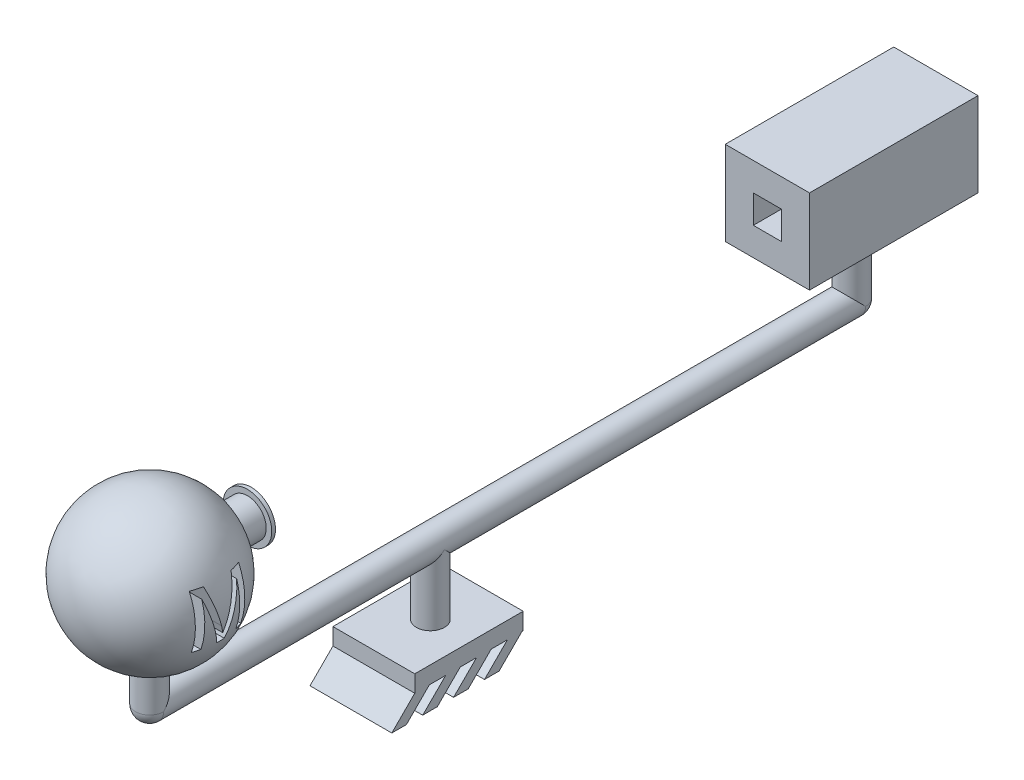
ISO-10303-21;
HEADER;
FILE_DESCRIPTION(('STEP AP214'),'2;1');
FILE_NAME('part.step','',(''),(''),'','','');
FILE_SCHEMA(('AUTOMOTIVE_DESIGN { 1 0 10303 214 1 1 1 1 }'));
ENDSEC;
DATA;
#1=APPLICATION_CONTEXT('core data for automotive mechanical design processes');
#2=APPLICATION_PROTOCOL_DEFINITION('international standard','automotive_design',2000,#1);
#3=PRODUCT_CONTEXT('',#1,'mechanical');
#4=PRODUCT('Part','Part','',(#3));
#5=PRODUCT_RELATED_PRODUCT_CATEGORY('part','',(#4));
#6=PRODUCT_DEFINITION_FORMATION('','',#4);
#7=PRODUCT_DEFINITION_CONTEXT('part definition',#1,'design');
#8=PRODUCT_DEFINITION('design','',#6,#7);
#9=PRODUCT_DEFINITION_SHAPE('','',#8);
#10=(LENGTH_UNIT() NAMED_UNIT(*) SI_UNIT(.MILLI.,.METRE.));
#11=(NAMED_UNIT(*) PLANE_ANGLE_UNIT() SI_UNIT($,.RADIAN.));
#12=(NAMED_UNIT(*) SI_UNIT($,.STERADIAN.) SOLID_ANGLE_UNIT());
#13=UNCERTAINTY_MEASURE_WITH_UNIT(LENGTH_MEASURE(1.E-05),#10,'distance_accuracy_value','');
#14=(GEOMETRIC_REPRESENTATION_CONTEXT(3) GLOBAL_UNCERTAINTY_ASSIGNED_CONTEXT((#13)) GLOBAL_UNIT_ASSIGNED_CONTEXT((#10,
#11,#12)) REPRESENTATION_CONTEXT('',''));
#15=CARTESIAN_POINT('',(0.,0.,0.));
#16=DIRECTION('',(0.,0.,1.));
#17=DIRECTION('',(1.,0.,0.));
#18=AXIS2_PLACEMENT_3D('',#15,#16,#17);
#19=CARTESIAN_POINT('',(7.01117221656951,-15.,-9.51015026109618));
#20=DIRECTION('',(0.,1.,0.));
#21=DIRECTION('',(0.,0.,1.));
#22=AXIS2_PLACEMENT_3D('',#19,#20,#21);
#23=PLANE('',#22);
#24=DIRECTION('',(0.,0.,1.));
#25=VECTOR('',#24,1.);
#26=CARTESIAN_POINT('',(7.01117221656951,-15.,9.7933368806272));
#27=LINE('',#26,#25);
#28=CARTESIAN_POINT('',(7.01117221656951,-15.,-9.51015026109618));
#29=VERTEX_POINT('',#28);
#30=CARTESIAN_POINT('',(7.01117221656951,-15.,-9.30861680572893));
#31=VERTEX_POINT('',#30);
#32=EDGE_CURVE('E575',#29,#31,#27,.T.);
#33=ORIENTED_EDGE('',*,*,#32,.T.);
#34=DIRECTION('',(1.,0.,0.));
#35=VECTOR('',#34,1.);
#36=CARTESIAN_POINT('',(-15.3955238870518,-15.,-9.30861680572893));
#37=LINE('',#36,#35);
#38=CARTESIAN_POINT('',(-7.5574973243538,-15.,-9.30861680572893));
#39=VERTEX_POINT('',#38);
#40=EDGE_CURVE('E706',#39,#31,#37,.T.);
#41=ORIENTED_EDGE('',*,*,#40,.F.);
#42=DIRECTION('',(0.,0.,-1.));
#43=VECTOR('',#42,1.);
#44=CARTESIAN_POINT('',(-7.5574973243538,-15.,9.7933368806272));
#45=LINE('',#44,#43);
#46=CARTESIAN_POINT('',(-7.5574973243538,-15.,-9.51015026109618));
#47=VERTEX_POINT('',#46);
#48=EDGE_CURVE('E567',#39,#47,#45,.T.);
#49=ORIENTED_EDGE('',*,*,#48,.T.);
#50=DIRECTION('',(1.,0.,0.));
#51=VECTOR('',#50,1.);
#52=CARTESIAN_POINT('',(7.01117221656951,-15.,-9.51015026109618));
#53=LINE('',#52,#51);
#54=EDGE_CURVE('E501',#47,#29,#53,.T.);
#55=ORIENTED_EDGE('',*,*,#54,.T.);
#56=EDGE_LOOP('',(#33,#41,#49,#55));
#57=FACE_BOUND('',#56,.T.);
#58=ADVANCED_FACE('F32',(#57),#23,.F.);
#59=CARTESIAN_POINT('',(-7.5574973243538,-15.,-3.80861680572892));
#60=VERTEX_POINT('',#59);
#61=CARTESIAN_POINT('',(-7.5574973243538,-15.,-6.7066631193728));
#62=VERTEX_POINT('',#61);
#63=EDGE_CURVE('E555',#60,#62,#45,.T.);
#64=ORIENTED_EDGE('',*,*,#63,.T.);
#65=DIRECTION('',(1.,0.,0.));
#66=VECTOR('',#65,1.);
#67=CARTESIAN_POINT('',(-15.3955238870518,-15.,-6.7066631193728));
#68=LINE('',#67,#66);
#69=CARTESIAN_POINT('',(7.01117221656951,-15.,-6.7066631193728));
#70=VERTEX_POINT('',#69);
#71=EDGE_CURVE('E55',#62,#70,#68,.T.);
#72=ORIENTED_EDGE('',*,*,#71,.T.);
#73=CARTESIAN_POINT('',(7.01117221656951,-15.,-3.80861680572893));
#74=VERTEX_POINT('',#73);
#75=EDGE_CURVE('E450',#70,#74,#27,.T.);
#76=ORIENTED_EDGE('',*,*,#75,.T.);
#77=DIRECTION('',(1.,0.,0.));
#78=VECTOR('',#77,1.);
#79=CARTESIAN_POINT('',(-15.3955238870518,-15.,-3.80861680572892));
#80=LINE('',#79,#78);
#81=EDGE_CURVE('E720',#60,#74,#80,.T.);
#82=ORIENTED_EDGE('',*,*,#81,.F.);
#83=EDGE_LOOP('',(#64,#72,#76,#82));
#84=FACE_BOUND('',#83,.T.);
#85=ADVANCED_FACE('F476',(#84),#23,.F.);
#86=CARTESIAN_POINT('',(-7.5574973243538,-15.,1.69138319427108));
#87=VERTEX_POINT('',#86);
#88=CARTESIAN_POINT('',(-7.5574973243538,-15.,-1.20666311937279));
#89=VERTEX_POINT('',#88);
#90=EDGE_CURVE('E502',#87,#89,#45,.T.);
#91=ORIENTED_EDGE('',*,*,#90,.T.);
#92=DIRECTION('',(1.,0.,0.));
#93=VECTOR('',#92,1.);
#94=CARTESIAN_POINT('',(-15.3955238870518,-15.,-1.2066631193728));
#95=LINE('',#94,#93);
#96=CARTESIAN_POINT('',(7.01117221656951,-15.,-1.20666311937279));
#97=VERTEX_POINT('',#96);
#98=EDGE_CURVE('E731',#89,#97,#95,.T.);
#99=ORIENTED_EDGE('',*,*,#98,.T.);
#100=CARTESIAN_POINT('',(7.01117221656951,-15.,1.69138319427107));
#101=VERTEX_POINT('',#100);
#102=EDGE_CURVE('E568',#97,#101,#27,.T.);
#103=ORIENTED_EDGE('',*,*,#102,.T.);
#104=DIRECTION('',(1.,0.,0.));
#105=VECTOR('',#104,1.);
#106=CARTESIAN_POINT('',(-15.3955238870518,-15.,1.69138319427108));
#107=LINE('',#106,#105);
#108=EDGE_CURVE('E742',#87,#101,#107,.T.);
#109=ORIENTED_EDGE('',*,*,#108,.F.);
#110=EDGE_LOOP('',(#91,#99,#103,#109));
#111=FACE_BOUND('',#110,.T.);
#112=ADVANCED_FACE('F482',(#111),#23,.F.);
#113=CARTESIAN_POINT('',(-7.5574973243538,-15.,7.19138319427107));
#114=VERTEX_POINT('',#113);
#115=CARTESIAN_POINT('',(-7.5574973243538,-15.,4.2933368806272));
#116=VERTEX_POINT('',#115);
#117=EDGE_CURVE('E492',#114,#116,#45,.T.);
#118=ORIENTED_EDGE('',*,*,#117,.T.);
#119=DIRECTION('',(1.,0.,0.));
#120=VECTOR('',#119,1.);
#121=CARTESIAN_POINT('',(-15.3955238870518,-15.,4.2933368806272));
#122=LINE('',#121,#120);
#123=CARTESIAN_POINT('',(7.01117221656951,-15.,4.2933368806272));
#124=VERTEX_POINT('',#123);
#125=EDGE_CURVE('E495',#116,#124,#122,.T.);
#126=ORIENTED_EDGE('',*,*,#125,.T.);
#127=CARTESIAN_POINT('',(7.01117221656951,-15.,7.19138319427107));
#128=VERTEX_POINT('',#127);
#129=EDGE_CURVE('E556',#124,#128,#27,.T.);
#130=ORIENTED_EDGE('',*,*,#129,.T.);
#131=DIRECTION('',(1.,0.,0.));
#132=VECTOR('',#131,1.);
#133=CARTESIAN_POINT('',(-15.3955238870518,-15.,7.19138319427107));
#134=LINE('',#133,#132);
#135=EDGE_CURVE('E498',#114,#128,#134,.T.);
#136=ORIENTED_EDGE('',*,*,#135,.F.);
#137=EDGE_LOOP('',(#118,#126,#130,#136));
#138=FACE_BOUND('',#137,.T.);
#139=ADVANCED_FACE('F465',(#138),#23,.F.);
#140=CARTESIAN_POINT('',(0.,20.,-75.));
#141=DIRECTION('',(0.,-1.,0.));
#142=DIRECTION('',(0.,0.,-1.));
#143=AXIS2_PLACEMENT_3D('',#140,#141,#142);
#144=CYLINDRICAL_SURFACE('',#143,2.5);
#145=CARTESIAN_POINT('',(0.,0.,-75.));
#146=DIRECTION('',(0.,1.,0.));
#147=DIRECTION('',(0.,0.,1.));
#148=AXIS2_PLACEMENT_3D('',#145,#146,#147);
#149=CIRCLE('',#148,2.5);
#150=CARTESIAN_POINT('',(2.5,0.,-75.));
#151=VERTEX_POINT('',#150);
#152=CARTESIAN_POINT('',(-2.5,0.,-75.));
#153=VERTEX_POINT('',#152);
#154=EDGE_CURVE('E607',#151,#153,#149,.T.);
#155=ORIENTED_EDGE('',*,*,#154,.T.);
#156=CARTESIAN_POINT('',(0.,0.,-75.));
#157=DIRECTION('',(0.,0.707106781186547,-0.707106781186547));
#158=DIRECTION('',(0.,-0.707106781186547,-0.707106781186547));
#159=AXIS2_PLACEMENT_3D('',#156,#157,#158);
#160=ELLIPSE('',#159,3.53553390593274,2.5);
#161=EDGE_CURVE('E604',#153,#151,#160,.T.);
#162=ORIENTED_EDGE('',*,*,#161,.T.);
#163=EDGE_LOOP('',(#155,#162));
#164=FACE_BOUND('',#163,.T.);
#165=CARTESIAN_POINT('',(0.,12.5,-75.));
#166=DIRECTION('',(0.,1.,0.));
#167=DIRECTION('',(0.,0.,1.));
#168=AXIS2_PLACEMENT_3D('',#165,#166,#167);
#169=CIRCLE('',#168,2.5);
#170=CARTESIAN_POINT('',(0.,12.5,-72.5));
#171=VERTEX_POINT('',#170);
#172=EDGE_CURVE('E590',#171,#171,#169,.T.);
#173=ORIENTED_EDGE('',*,*,#172,.F.);
#174=EDGE_LOOP('',(#173));
#175=FACE_BOUND('',#174,.T.);
#176=ADVANCED_FACE('F462',(#164,#175),#144,.T.);
#177=CARTESIAN_POINT('',(0.,0.,50.));
#178=DIRECTION('',(0.,0.,-1.));
#179=DIRECTION('',(-1.,0.,0.));
#180=AXIS2_PLACEMENT_3D('',#177,#178,#179);
#181=CYLINDRICAL_SURFACE('',#180,2.5);
#182=ORIENTED_EDGE('',*,*,#161,.F.);
#183=CARTESIAN_POINT('',(0.,0.,-75.));
#184=DIRECTION('',(0.,0.,1.));
#185=DIRECTION('',(1.,0.,0.));
#186=AXIS2_PLACEMENT_3D('',#183,#184,#185);
#187=CIRCLE('',#186,2.5);
#188=EDGE_CURVE('E601',#153,#151,#187,.T.);
#189=ORIENTED_EDGE('',*,*,#188,.T.);
#190=EDGE_LOOP('',(#182,#189));
#191=FACE_BOUND('',#190,.T.);
#192=CARTESIAN_POINT('',(0.,0.,0.));
#193=DIRECTION('',(0.,0.707106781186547,-0.707106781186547));
#194=DIRECTION('',(0.,0.707106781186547,0.707106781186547));
#195=AXIS2_PLACEMENT_3D('',#192,#193,#194);
#196=ELLIPSE('',#195,3.53553390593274,2.5);
#197=CARTESIAN_POINT('',(-2.5,0.,0.));
#198=VERTEX_POINT('',#197);
#199=CARTESIAN_POINT('',(2.5,0.,0.));
#200=VERTEX_POINT('',#199);
#201=EDGE_CURVE('E593',#198,#200,#196,.F.);
#202=ORIENTED_EDGE('',*,*,#201,.F.);
#203=CARTESIAN_POINT('',(0.,0.,0.));
#204=DIRECTION('',(0.,0.707106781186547,0.707106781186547));
#205=DIRECTION('',(0.,0.707106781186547,-0.707106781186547));
#206=AXIS2_PLACEMENT_3D('',#203,#204,#205);
#207=ELLIPSE('',#206,3.53553390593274,2.5);
#208=EDGE_CURVE('E596',#200,#198,#207,.F.);
#209=ORIENTED_EDGE('',*,*,#208,.F.);
#210=EDGE_LOOP('',(#202,#209));
#211=FACE_BOUND('',#210,.T.);
#212=CARTESIAN_POINT('',(0.,0.,50.));
#213=DIRECTION('',(0.,-0.707106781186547,-0.707106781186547));
#214=DIRECTION('',(0.,0.707106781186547,-0.707106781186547));
#215=AXIS2_PLACEMENT_3D('',#212,#213,#214);
#216=ELLIPSE('',#215,3.53553390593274,2.5);
#217=CARTESIAN_POINT('',(2.5,0.,50.));
#218=VERTEX_POINT('',#217);
#219=CARTESIAN_POINT('',(-2.5,0.,50.));
#220=VERTEX_POINT('',#219);
#221=EDGE_CURVE('E610',#218,#220,#216,.F.);
#222=ORIENTED_EDGE('',*,*,#221,.F.);
#223=CARTESIAN_POINT('',(0.,0.,50.));
#224=DIRECTION('',(0.,0.,1.));
#225=DIRECTION('',(1.,0.,0.));
#226=AXIS2_PLACEMENT_3D('',#223,#224,#225);
#227=CIRCLE('',#226,2.5);
#228=EDGE_CURVE('E599',#220,#218,#227,.T.);
#229=ORIENTED_EDGE('',*,*,#228,.F.);
#230=EDGE_LOOP('',(#222,#229));
#231=FACE_BOUND('',#230,.T.);
#232=ADVANCED_FACE('F464',(#191,#211,#231),#181,.T.);
#233=CARTESIAN_POINT('',(0.,-12.,0.));
#234=DIRECTION('',(0.,1.,0.));
#235=DIRECTION('',(0.,0.,1.));
#236=AXIS2_PLACEMENT_3D('',#233,#234,#235);
#237=CYLINDRICAL_SURFACE('',#236,2.5);
#238=CARTESIAN_POINT('',(0.,-12.,0.));
#239=DIRECTION('',(0.,1.,0.));
#240=DIRECTION('',(0.,0.,1.));
#241=AXIS2_PLACEMENT_3D('',#238,#239,#240);
#242=CIRCLE('',#241,2.5);
#243=CARTESIAN_POINT('',(0.,-12.,2.5));
#244=VERTEX_POINT('',#243);
#245=EDGE_CURVE('E665',#244,#244,#242,.F.);
#246=ORIENTED_EDGE('',*,*,#245,.F.);
#247=EDGE_LOOP('',(#246));
#248=FACE_BOUND('',#247,.T.);
#249=ORIENTED_EDGE('',*,*,#208,.T.);
#250=ORIENTED_EDGE('',*,*,#201,.T.);
#251=EDGE_LOOP('',(#249,#250));
#252=FACE_BOUND('',#251,.T.);
#253=ADVANCED_FACE('F34',(#248,#252),#237,.T.);
#254=CARTESIAN_POINT('',(0.,20.,50.));
#255=DIRECTION('',(0.,-1.,0.));
#256=DIRECTION('',(0.,0.,-1.));
#257=AXIS2_PLACEMENT_3D('',#254,#255,#256);
#258=CYLINDRICAL_SURFACE('',#257,2.5);
#259=CARTESIAN_POINT('',(-1.76966585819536,7.11869382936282,48.2341339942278));
#260=CARTESIAN_POINT('',(-1.6704734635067,7.11804633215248,48.1347369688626));
#261=CARTESIAN_POINT('',(-1.56281468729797,7.11745297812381,48.0436439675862));
#262=CARTESIAN_POINT('',(-1.3336401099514,7.11639200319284,47.8807518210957));
#263=CARTESIAN_POINT('',(-1.21210777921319,7.11592453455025,47.8089760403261));
#264=CARTESIAN_POINT('',(-0.958762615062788,7.11512935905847,47.6868790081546));
#265=CARTESIAN_POINT('',(-0.826954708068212,7.11480158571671,47.6365475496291));
#266=CARTESIAN_POINT('',(-0.556795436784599,7.11429490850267,47.5587427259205));
#267=CARTESIAN_POINT('',(-0.418445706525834,7.11411596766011,47.5312636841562));
#268=CARTESIAN_POINT('',(-0.139082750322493,7.11391184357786,47.4999173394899));
#269=CARTESIAN_POINT('',(0.00193072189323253,7.11388667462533,47.4960522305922));
#270=CARTESIAN_POINT('',(0.282610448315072,7.11399085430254,47.5120507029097));
#271=CARTESIAN_POINT('',(0.422276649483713,7.11412020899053,47.5319152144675));
#272=CARTESIAN_POINT('',(0.696288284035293,7.11452977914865,47.5948094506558));
#273=CARTESIAN_POINT('',(0.830633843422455,7.11480999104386,47.6378386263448));
#274=CARTESIAN_POINT('',(1.09019379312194,7.11551334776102,47.7458401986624));
#275=CARTESIAN_POINT('',(1.21540820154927,7.1159364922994,47.8108125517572));
#276=CARTESIAN_POINT('',(1.45315312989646,7.11691374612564,47.9608567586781));
#277=CARTESIAN_POINT('',(1.56568351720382,7.11746785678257,48.0459288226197));
#278=CARTESIAN_POINT('',(1.77486452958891,7.11869135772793,48.2337568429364));
#279=CARTESIAN_POINT('',(1.87151518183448,7.11936074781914,48.3365127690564));
#280=CARTESIAN_POINT('',(2.04619531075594,7.12079586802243,48.55679373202));
#281=CARTESIAN_POINT('',(2.12422443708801,7.12156159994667,48.67431904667));
#282=CARTESIAN_POINT('',(2.25944449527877,7.12316770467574,48.9208011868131));
#283=CARTESIAN_POINT('',(2.31663540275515,7.1240080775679,49.0497580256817));
#284=CARTESIAN_POINT('',(2.40855659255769,7.12573966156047,49.3154451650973));
#285=CARTESIAN_POINT('',(2.44328642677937,7.12663087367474,49.4521756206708));
#286=CARTESIAN_POINT('',(2.48929790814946,7.12843884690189,49.7295262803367));
#287=CARTESIAN_POINT('',(2.50057956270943,7.1293556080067,49.8701464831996));
#288=CARTESIAN_POINT('',(2.49937449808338,7.13118867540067,50.1512869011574));
#289=CARTESIAN_POINT('',(2.48688746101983,7.13210498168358,50.29180711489));
#290=CARTESIAN_POINT('',(2.43849880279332,7.13391110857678,50.5687567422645));
#291=CARTESIAN_POINT('',(2.40259717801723,7.13480092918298,50.7051861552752));
#292=CARTESIAN_POINT('',(2.30839834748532,7.13652879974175,50.9700813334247));
#293=CARTESIAN_POINT('',(2.25010113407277,7.13736684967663,51.0985470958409));
#294=CARTESIAN_POINT('',(2.11276586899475,7.13896735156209,51.3438680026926));
#295=CARTESIAN_POINT('',(2.03372781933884,7.13972980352,51.4607231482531));
#296=CARTESIAN_POINT('',(1.85715554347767,7.14115740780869,51.6795040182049));
#297=CARTESIAN_POINT('',(1.75962155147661,7.14182256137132,51.7814299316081));
#298=CARTESIAN_POINT('',(1.5488253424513,7.14303664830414,51.9674604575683));
#299=CARTESIAN_POINT('',(1.43556312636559,7.14358558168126,52.0515650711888));
#300=CARTESIAN_POINT('',(1.19652808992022,7.14455158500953,52.1995636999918));
#301=CARTESIAN_POINT('',(1.07075552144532,7.14496865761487,52.2634581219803));
#302=CARTESIAN_POINT('',(0.810268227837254,7.14565907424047,52.3692246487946));
#303=CARTESIAN_POINT('',(0.675553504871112,7.14593241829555,52.4110967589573));
#304=CARTESIAN_POINT('',(0.401008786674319,7.1463275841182,52.4716292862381));
#305=CARTESIAN_POINT('',(0.261178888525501,7.14644940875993,52.4902901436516));
#306=CARTESIAN_POINT('',(-0.0196292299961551,7.14653807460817,52.5038718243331));
#307=CARTESIAN_POINT('',(-0.160607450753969,7.14650491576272,52.4987926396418));
#308=CARTESIAN_POINT('',(-0.439708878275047,7.14628455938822,52.4650385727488));
#309=CARTESIAN_POINT('',(-0.577832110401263,7.14609736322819,52.4363639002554));
#310=CARTESIAN_POINT('',(-0.847303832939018,7.14557426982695,52.356233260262));
#311=CARTESIAN_POINT('',(-0.978652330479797,7.14523837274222,52.3047773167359));
#312=CARTESIAN_POINT('',(-1.23084678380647,7.14442744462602,52.1805447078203));
#313=CARTESIAN_POINT('',(-1.35169269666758,7.14395241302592,52.1077679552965));
#314=CARTESIAN_POINT('',(-1.57945133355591,7.14287674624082,51.9429597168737));
#315=CARTESIAN_POINT('',(-1.6863640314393,7.14227611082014,51.8509281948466));
#316=CARTESIAN_POINT('',(-1.88322274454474,7.14096632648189,51.6502216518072));
#317=CARTESIAN_POINT('',(-1.97316851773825,7.14025717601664,51.5415463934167));
#318=CARTESIAN_POINT('',(-2.13353862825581,7.13875054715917,51.310638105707));
#319=CARTESIAN_POINT('',(-2.20396292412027,7.13795306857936,51.1884050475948));
#320=CARTESIAN_POINT('',(-2.32329340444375,7.13629243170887,50.9338461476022));
#321=CARTESIAN_POINT('',(-2.37219874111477,7.13542927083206,50.8015199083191));
#322=CARTESIAN_POINT('',(-2.44709741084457,7.1336618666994,50.5305403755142));
#323=CARTESIAN_POINT('',(-2.47309164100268,7.13275762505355,50.3918873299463));
#324=CARTESIAN_POINT('',(-2.50143321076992,7.13093379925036,50.1121984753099));
#325=CARTESIAN_POINT('',(-2.5037826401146,7.13001421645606,49.9711628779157));
#326=CARTESIAN_POINT('',(-2.48476792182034,7.12818547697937,49.6906607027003));
#327=CARTESIAN_POINT('',(-2.46339787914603,7.12727632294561,49.5511945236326));
#328=CARTESIAN_POINT('',(-2.39753699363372,7.1254941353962,49.2777750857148));
#329=CARTESIAN_POINT('',(-2.3530350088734,7.12462111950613,49.1438245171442));
#330=CARTESIAN_POINT('',(-2.2421920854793,7.12293712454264,48.8854172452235));
#331=CARTESIAN_POINT('',(-2.17587748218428,7.12212607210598,48.7609493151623));
#332=CARTESIAN_POINT('',(-2.052025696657,7.12087734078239,48.5692968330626));
#333=CARTESIAN_POINT('',(-2.00052544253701,7.12041371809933,48.4981369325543));
#334=CARTESIAN_POINT('',(-1.89034098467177,7.11952429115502,48.3616149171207));
#335=CARTESIAN_POINT('',(-1.83165678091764,7.11909848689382,48.2962528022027));
#336=CARTESIAN_POINT('',(-1.76966585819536,7.11869382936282,48.2341339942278));
#337=B_SPLINE_CURVE_WITH_KNOTS('',3,(#259,#260,#261,#262,#263,#264,#265,#266,#267,#268,#269,
#270,#271,#272,#273,#274,#275,#276,#277,#278,#279,#280,#281,#282,#283,#284,#285,#286,#287,#288,
#289,#290,#291,#292,#293,#294,#295,#296,#297,#298,#299,#300,#301,#302,#303,#304,#305,#306,#307,
#308,#309,#310,#311,#312,#313,#314,#315,#316,#317,#318,#319,#320,#321,#322,#323,#324,#325,#326,
#327,#328,#329,#330,#331,#332,#333,#334,#335,#336),.UNSPECIFIED.,.T.,.F.,(4,2,2,2,2,2,2,2,2,2,2,
2,2,2,2,2,2,2,2,2,2,2,2,2,2,2,2,2,2,2,2,2,2,2,2,2,2,2,4),(0.,0.420956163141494,
0.842419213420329,1.26368142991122,1.68483897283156,2.10603564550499,2.52724883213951,
2.94845203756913,3.36965440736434,3.79086118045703,4.21206723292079,4.63328120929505,
5.05449567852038,5.47571855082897,5.8969412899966,6.31816966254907,6.73939810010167,
7.16062668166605,7.58185522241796,8.00307842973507,8.42430161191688,8.84551631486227,
9.26673091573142,9.68793752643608,10.1091442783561,10.5303472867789,10.9515498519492,
11.3727541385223,11.7939592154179,12.2151703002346,12.6363822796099,13.0576108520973,
13.4788229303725,13.8999977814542,14.321277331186,14.742759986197,15.1637356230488,
15.4268148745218,15.6898941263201),.UNSPECIFIED.);
#338=CARTESIAN_POINT('',(-1.76966585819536,7.11869382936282,48.2341339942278));
#339=VERTEX_POINT('',#338);
#340=EDGE_CURVE('E441',#339,#339,#337,.T.);
#341=ORIENTED_EDGE('',*,*,#340,.T.);
#342=EDGE_LOOP('',(#341));
#343=FACE_BOUND('',#342,.T.);
#344=CARTESIAN_POINT('',(0.,0.,50.));
#345=DIRECTION('',(0.,1.,0.));
#346=DIRECTION('',(0.,0.,1.));
#347=AXIS2_PLACEMENT_3D('',#344,#345,#346);
#348=CIRCLE('',#347,2.5);
#349=EDGE_CURVE('E613',#220,#218,#348,.T.);
#350=ORIENTED_EDGE('',*,*,#349,.T.);
#351=ORIENTED_EDGE('',*,*,#221,.T.);
#352=EDGE_LOOP('',(#350,#351));
#353=FACE_BOUND('',#352,.T.);
#354=ADVANCED_FACE('F453',(#343,#353),#258,.T.);
#355=CARTESIAN_POINT('',(7.5,12.5,-60.));
#356=DIRECTION('',(0.,1.,0.));
#357=DIRECTION('',(0.,0.,1.));
#358=AXIS2_PLACEMENT_3D('',#355,#356,#357);
#359=PLANE('',#358);
#360=DIRECTION('',(-1.,0.,0.));
#361=VECTOR('',#360,1.);
#362=CARTESIAN_POINT('',(7.5,12.5,-60.));
#363=LINE('',#362,#361);
#364=CARTESIAN_POINT('',(7.5,12.5,-60.));
#365=VERTEX_POINT('',#364);
#366=CARTESIAN_POINT('',(-7.5,12.5,-60.));
#367=VERTEX_POINT('',#366);
#368=EDGE_CURVE('E616',#365,#367,#363,.T.);
#369=ORIENTED_EDGE('',*,*,#368,.T.);
#370=DIRECTION('',(0.,0.,-1.));
#371=VECTOR('',#370,1.);
#372=CARTESIAN_POINT('',(-7.5,12.5,-60.));
#373=LINE('',#372,#371);
#374=CARTESIAN_POINT('',(-7.5,12.5,-90.));
#375=VERTEX_POINT('',#374);
#376=EDGE_CURVE('E639',#367,#375,#373,.T.);
#377=ORIENTED_EDGE('',*,*,#376,.T.);
#378=DIRECTION('',(-1.,0.,0.));
#379=VECTOR('',#378,1.);
#380=CARTESIAN_POINT('',(7.5,12.5,-90.));
#381=LINE('',#380,#379);
#382=CARTESIAN_POINT('',(7.5,12.5,-90.));
#383=VERTEX_POINT('',#382);
#384=EDGE_CURVE('E618',#383,#375,#381,.T.);
#385=ORIENTED_EDGE('',*,*,#384,.F.);
#386=DIRECTION('',(0.,0.,-1.));
#387=VECTOR('',#386,1.);
#388=CARTESIAN_POINT('',(7.5,12.5,-60.));
#389=LINE('',#388,#387);
#390=EDGE_CURVE('E628',#365,#383,#389,.T.);
#391=ORIENTED_EDGE('',*,*,#390,.F.);
#392=EDGE_LOOP('',(#369,#377,#385,#391));
#393=FACE_BOUND('',#392,.T.);
#394=ORIENTED_EDGE('',*,*,#172,.T.);
#395=EDGE_LOOP('',(#394));
#396=FACE_BOUND('',#395,.T.);
#397=ADVANCED_FACE('F458',(#393,#396),#359,.F.);
#398=CARTESIAN_POINT('',(7.5,27.5,-60.));
#399=DIRECTION('',(0.,0.,-1.));
#400=DIRECTION('',(-1.,0.,0.));
#401=AXIS2_PLACEMENT_3D('',#398,#399,#400);
#402=PLANE('',#401);
#403=DIRECTION('',(-1.,0.,0.));
#404=VECTOR('',#403,1.);
#405=CARTESIAN_POINT('',(2.5,22.5,-60.));
#406=LINE('',#405,#404);
#407=CARTESIAN_POINT('',(2.5,22.5,-60.));
#408=VERTEX_POINT('',#407);
#409=CARTESIAN_POINT('',(-2.5,22.5,-60.));
#410=VERTEX_POINT('',#409);
#411=EDGE_CURVE('E660',#408,#410,#406,.T.);
#412=ORIENTED_EDGE('',*,*,#411,.F.);
#413=DIRECTION('',(0.,1.,0.));
#414=VECTOR('',#413,1.);
#415=CARTESIAN_POINT('',(2.5,22.5,-60.));
#416=LINE('',#415,#414);
#417=CARTESIAN_POINT('',(2.5,17.5,-60.));
#418=VERTEX_POINT('',#417);
#419=EDGE_CURVE('E663',#418,#408,#416,.T.);
#420=ORIENTED_EDGE('',*,*,#419,.F.);
#421=DIRECTION('',(1.,0.,0.));
#422=VECTOR('',#421,1.);
#423=CARTESIAN_POINT('',(2.5,17.5,-60.));
#424=LINE('',#423,#422);
#425=CARTESIAN_POINT('',(-2.5,17.5,-60.));
#426=VERTEX_POINT('',#425);
#427=EDGE_CURVE('E650',#426,#418,#424,.T.);
#428=ORIENTED_EDGE('',*,*,#427,.F.);
#429=DIRECTION('',(0.,-1.,0.));
#430=VECTOR('',#429,1.);
#431=CARTESIAN_POINT('',(-2.5,22.5,-60.));
#432=LINE('',#431,#430);
#433=EDGE_CURVE('E657',#410,#426,#432,.T.);
#434=ORIENTED_EDGE('',*,*,#433,.F.);
#435=EDGE_LOOP('',(#412,#420,#428,#434));
#436=FACE_BOUND('',#435,.T.);
#437=DIRECTION('',(-1.,0.,0.));
#438=VECTOR('',#437,1.);
#439=CARTESIAN_POINT('',(7.5,27.5,-60.));
#440=LINE('',#439,#438);
#441=CARTESIAN_POINT('',(7.5,27.5,-60.));
#442=VERTEX_POINT('',#441);
#443=CARTESIAN_POINT('',(-7.5,27.5,-60.));
#444=VERTEX_POINT('',#443);
#445=EDGE_CURVE('E622',#442,#444,#440,.T.);
#446=ORIENTED_EDGE('',*,*,#445,.T.);
#447=DIRECTION('',(0.,-1.,0.));
#448=VECTOR('',#447,1.);
#449=CARTESIAN_POINT('',(-7.5,27.5,-60.));
#450=LINE('',#449,#448);
#451=EDGE_CURVE('E642',#444,#367,#450,.T.);
#452=ORIENTED_EDGE('',*,*,#451,.T.);
#453=ORIENTED_EDGE('',*,*,#368,.F.);
#454=DIRECTION('',(0.,-1.,0.));
#455=VECTOR('',#454,1.);
#456=CARTESIAN_POINT('',(7.5,27.5,-60.));
#457=LINE('',#456,#455);
#458=EDGE_CURVE('E630',#442,#365,#457,.T.);
#459=ORIENTED_EDGE('',*,*,#458,.F.);
#460=EDGE_LOOP('',(#446,#452,#453,#459));
#461=FACE_BOUND('',#460,.T.);
#462=ADVANCED_FACE('F460',(#436,#461),#402,.F.);
#463=CARTESIAN_POINT('',(7.5,27.5,-90.));
#464=DIRECTION('',(0.,0.,1.));
#465=DIRECTION('',(0.,-1.,0.));
#466=AXIS2_PLACEMENT_3D('',#463,#464,#465);
#467=PLANE('',#466);
#468=DIRECTION('',(1.,0.,0.));
#469=VECTOR('',#468,1.);
#470=CARTESIAN_POINT('',(7.5,17.5,-90.));
#471=LINE('',#470,#469);
#472=CARTESIAN_POINT('',(-2.5,17.5,-90.));
#473=VERTEX_POINT('',#472);
#474=CARTESIAN_POINT('',(2.5,17.5,-90.));
#475=VERTEX_POINT('',#474);
#476=EDGE_CURVE('E581',#473,#475,#471,.T.);
#477=ORIENTED_EDGE('',*,*,#476,.T.);
#478=DIRECTION('',(0.,1.,0.));
#479=VECTOR('',#478,1.);
#480=CARTESIAN_POINT('',(2.5,27.5,-90.));
#481=LINE('',#480,#479);
#482=CARTESIAN_POINT('',(2.5,22.5,-90.));
#483=VERTEX_POINT('',#482);
#484=EDGE_CURVE('E578',#475,#483,#481,.T.);
#485=ORIENTED_EDGE('',*,*,#484,.T.);
#486=DIRECTION('',(-1.,0.,0.));
#487=VECTOR('',#486,1.);
#488=CARTESIAN_POINT('',(7.5,22.5,-90.));
#489=LINE('',#488,#487);
#490=CARTESIAN_POINT('',(-2.5,22.5,-90.));
#491=VERTEX_POINT('',#490);
#492=EDGE_CURVE('E587',#483,#491,#489,.T.);
#493=ORIENTED_EDGE('',*,*,#492,.T.);
#494=DIRECTION('',(0.,-1.,0.));
#495=VECTOR('',#494,1.);
#496=CARTESIAN_POINT('',(-2.5,27.5,-90.));
#497=LINE('',#496,#495);
#498=EDGE_CURVE('E584',#491,#473,#497,.T.);
#499=ORIENTED_EDGE('',*,*,#498,.T.);
#500=EDGE_LOOP('',(#477,#485,#493,#499));
#501=FACE_BOUND('',#500,.T.);
#502=ORIENTED_EDGE('',*,*,#384,.T.);
#503=DIRECTION('',(0.,1.,0.));
#504=VECTOR('',#503,1.);
#505=CARTESIAN_POINT('',(-7.5,27.5,-90.));
#506=LINE('',#505,#504);
#507=CARTESIAN_POINT('',(-7.5,27.5,-90.));
#508=VERTEX_POINT('',#507);
#509=EDGE_CURVE('E636',#375,#508,#506,.T.);
#510=ORIENTED_EDGE('',*,*,#509,.T.);
#511=DIRECTION('',(-1.,0.,0.));
#512=VECTOR('',#511,1.);
#513=CARTESIAN_POINT('',(7.5,27.5,-90.));
#514=LINE('',#513,#512);
#515=CARTESIAN_POINT('',(7.5,27.5,-90.));
#516=VERTEX_POINT('',#515);
#517=EDGE_CURVE('E620',#516,#508,#514,.T.);
#518=ORIENTED_EDGE('',*,*,#517,.F.);
#519=DIRECTION('',(0.,1.,0.));
#520=VECTOR('',#519,1.);
#521=CARTESIAN_POINT('',(7.5,27.5,-90.));
#522=LINE('',#521,#520);
#523=EDGE_CURVE('E626',#383,#516,#522,.T.);
#524=ORIENTED_EDGE('',*,*,#523,.F.);
#525=EDGE_LOOP('',(#502,#510,#518,#524));
#526=FACE_BOUND('',#525,.T.);
#527=ADVANCED_FACE('F986',(#501,#526),#467,.F.);
#528=CARTESIAN_POINT('',(7.5,27.5,-60.));
#529=DIRECTION('',(0.,-1.,0.));
#530=DIRECTION('',(0.,0.,-1.));
#531=AXIS2_PLACEMENT_3D('',#528,#529,#530);
#532=PLANE('',#531);
#533=ORIENTED_EDGE('',*,*,#517,.T.);
#534=DIRECTION('',(0.,0.,1.));
#535=VECTOR('',#534,1.);
#536=CARTESIAN_POINT('',(-7.5,27.5,-60.));
#537=LINE('',#536,#535);
#538=EDGE_CURVE('E633',#508,#444,#537,.T.);
#539=ORIENTED_EDGE('',*,*,#538,.T.);
#540=ORIENTED_EDGE('',*,*,#445,.F.);
#541=DIRECTION('',(0.,0.,1.));
#542=VECTOR('',#541,1.);
#543=CARTESIAN_POINT('',(7.5,27.5,-60.));
#544=LINE('',#543,#542);
#545=EDGE_CURVE('E624',#516,#442,#544,.T.);
#546=ORIENTED_EDGE('',*,*,#545,.F.);
#547=EDGE_LOOP('',(#533,#539,#540,#546));
#548=FACE_BOUND('',#547,.T.);
#549=ADVANCED_FACE('F982',(#548),#532,.F.);
#550=CARTESIAN_POINT('',(7.5,27.5,-60.));
#551=DIRECTION('',(1.,0.,0.));
#552=DIRECTION('',(0.,0.,-1.));
#553=AXIS2_PLACEMENT_3D('',#550,#551,#552);
#554=PLANE('',#553);
#555=ORIENTED_EDGE('',*,*,#458,.T.);
#556=ORIENTED_EDGE('',*,*,#390,.T.);
#557=ORIENTED_EDGE('',*,*,#523,.T.);
#558=ORIENTED_EDGE('',*,*,#545,.T.);
#559=EDGE_LOOP('',(#555,#556,#557,#558));
#560=FACE_BOUND('',#559,.T.);
#561=ADVANCED_FACE('F978',(#560),#554,.T.);
#562=CARTESIAN_POINT('',(-7.5,27.5,-60.));
#563=DIRECTION('',(1.,0.,0.));
#564=DIRECTION('',(0.,0.,-1.));
#565=AXIS2_PLACEMENT_3D('',#562,#563,#564);
#566=PLANE('',#565);
#567=ORIENTED_EDGE('',*,*,#451,.F.);
#568=ORIENTED_EDGE('',*,*,#538,.F.);
#569=ORIENTED_EDGE('',*,*,#509,.F.);
#570=ORIENTED_EDGE('',*,*,#376,.F.);
#571=EDGE_LOOP('',(#567,#568,#569,#570));
#572=FACE_BOUND('',#571,.T.);
#573=ADVANCED_FACE('F974',(#572),#566,.F.);
#574=CARTESIAN_POINT('',(2.5,22.5,-112.5));
#575=DIRECTION('',(1.,0.,0.));
#576=DIRECTION('',(0.,1.,0.));
#577=AXIS2_PLACEMENT_3D('',#574,#575,#576);
#578=PLANE('',#577);
#579=DIRECTION('',(0.,0.,1.));
#580=VECTOR('',#579,1.);
#581=CARTESIAN_POINT('',(2.5,17.5,-112.5));
#582=LINE('',#581,#580);
#583=EDGE_CURVE('E645',#475,#418,#582,.T.);
#584=ORIENTED_EDGE('',*,*,#583,.T.);
#585=ORIENTED_EDGE('',*,*,#419,.T.);
#586=DIRECTION('',(0.,0.,1.));
#587=VECTOR('',#586,1.);
#588=CARTESIAN_POINT('',(2.5,22.5,-112.5));
#589=LINE('',#588,#587);
#590=EDGE_CURVE('E646',#483,#408,#589,.T.);
#591=ORIENTED_EDGE('',*,*,#590,.F.);
#592=ORIENTED_EDGE('',*,*,#484,.F.);
#593=EDGE_LOOP('',(#584,#585,#591,#592));
#594=FACE_BOUND('',#593,.T.);
#595=ADVANCED_FACE('F964',(#594),#578,.F.);
#596=CARTESIAN_POINT('',(2.5,17.5,-112.5));
#597=DIRECTION('',(0.,-1.,0.));
#598=DIRECTION('',(0.,0.,-1.));
#599=AXIS2_PLACEMENT_3D('',#596,#597,#598);
#600=PLANE('',#599);
#601=DIRECTION('',(0.,0.,1.));
#602=VECTOR('',#601,1.);
#603=CARTESIAN_POINT('',(-2.5,17.5,-112.5));
#604=LINE('',#603,#602);
#605=EDGE_CURVE('E652',#473,#426,#604,.T.);
#606=ORIENTED_EDGE('',*,*,#605,.T.);
#607=ORIENTED_EDGE('',*,*,#427,.T.);
#608=ORIENTED_EDGE('',*,*,#583,.F.);
#609=ORIENTED_EDGE('',*,*,#476,.F.);
#610=EDGE_LOOP('',(#606,#607,#608,#609));
#611=FACE_BOUND('',#610,.T.);
#612=ADVANCED_FACE('F960',(#611),#600,.F.);
#613=CARTESIAN_POINT('',(-2.5,22.5,-112.5));
#614=DIRECTION('',(-1.,0.,0.));
#615=DIRECTION('',(0.,-1.,0.));
#616=AXIS2_PLACEMENT_3D('',#613,#614,#615);
#617=PLANE('',#616);
#618=DIRECTION('',(0.,0.,1.));
#619=VECTOR('',#618,1.);
#620=CARTESIAN_POINT('',(-2.5,22.5,-112.5));
#621=LINE('',#620,#619);
#622=EDGE_CURVE('E649',#491,#410,#621,.T.);
#623=ORIENTED_EDGE('',*,*,#622,.T.);
#624=ORIENTED_EDGE('',*,*,#433,.T.);
#625=ORIENTED_EDGE('',*,*,#605,.F.);
#626=ORIENTED_EDGE('',*,*,#498,.F.);
#627=EDGE_LOOP('',(#623,#624,#625,#626));
#628=FACE_BOUND('',#627,.T.);
#629=ADVANCED_FACE('F963',(#628),#617,.F.);
#630=CARTESIAN_POINT('',(2.5,22.5,-112.5));
#631=DIRECTION('',(0.,1.,0.));
#632=DIRECTION('',(0.,0.,1.));
#633=AXIS2_PLACEMENT_3D('',#630,#631,#632);
#634=PLANE('',#633);
#635=ORIENTED_EDGE('',*,*,#590,.T.);
#636=ORIENTED_EDGE('',*,*,#411,.T.);
#637=ORIENTED_EDGE('',*,*,#622,.F.);
#638=ORIENTED_EDGE('',*,*,#492,.F.);
#639=EDGE_LOOP('',(#635,#636,#637,#638));
#640=FACE_BOUND('',#639,.T.);
#641=ADVANCED_FACE('F957',(#640),#634,.F.);
#642=CARTESIAN_POINT('',(7.01117221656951,-15.,9.7933368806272));
#643=DIRECTION('',(-1.,0.,0.));
#644=DIRECTION('',(0.,0.,1.));
#645=AXIS2_PLACEMENT_3D('',#642,#643,#644);
#646=PLANE('',#645);
#647=DIRECTION('',(0.,0.,1.));
#648=VECTOR('',#647,1.);
#649=CARTESIAN_POINT('',(7.01117221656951,-12.,9.7933368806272));
#650=LINE('',#649,#648);
#651=CARTESIAN_POINT('',(7.01117221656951,-12.,-9.51015026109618));
#652=VERTEX_POINT('',#651);
#653=CARTESIAN_POINT('',(7.01117221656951,-12.,9.7933368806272));
#654=VERTEX_POINT('',#653);
#655=EDGE_CURVE('E931',#652,#654,#650,.T.);
#656=ORIENTED_EDGE('',*,*,#655,.T.);
#657=DIRECTION('',(0.,1.,0.));
#658=VECTOR('',#657,1.);
#659=CARTESIAN_POINT('',(7.01117221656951,-15.,9.7933368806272));
#660=LINE('',#659,#658);
#661=CARTESIAN_POINT('',(7.01117221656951,-15.,9.7933368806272));
#662=VERTEX_POINT('',#661);
#663=EDGE_CURVE('E668',#662,#654,#660,.T.);
#664=ORIENTED_EDGE('',*,*,#663,.F.);
#665=DIRECTION('',(0.,-0.707106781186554,0.707106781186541));
#666=VECTOR('',#665,1.);
#667=CARTESIAN_POINT('',(7.01117221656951,-15.,9.7933368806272));
#668=LINE('',#667,#666);
#669=CARTESIAN_POINT('',(7.01117221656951,-19.086489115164,13.8798259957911));
#670=VERTEX_POINT('',#669);
#671=EDGE_CURVE('E511',#662,#670,#668,.T.);
#672=ORIENTED_EDGE('',*,*,#671,.T.);
#673=DIRECTION('',(0.,0.,-1.));
#674=VECTOR('',#673,1.);
#675=CARTESIAN_POINT('',(7.01117221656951,-19.086489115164,13.8798259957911));
#676=LINE('',#675,#674);
#677=CARTESIAN_POINT('',(7.01117221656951,-19.086489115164,11.277872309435));
#678=VERTEX_POINT('',#677);
#679=EDGE_CURVE('E533',#670,#678,#676,.T.);
#680=ORIENTED_EDGE('',*,*,#679,.T.);
#681=DIRECTION('',(0.,0.707106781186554,-0.707106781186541));
#682=VECTOR('',#681,1.);
#683=CARTESIAN_POINT('',(7.01117221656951,-19.086489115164,11.277872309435));
#684=LINE('',#683,#682);
#685=EDGE_CURVE('E536',#678,#128,#684,.T.);
#686=ORIENTED_EDGE('',*,*,#685,.T.);
#687=ORIENTED_EDGE('',*,*,#129,.F.);
#688=DIRECTION('',(0.,-0.707106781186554,0.707106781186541));
#689=VECTOR('',#688,1.);
#690=CARTESIAN_POINT('',(7.01117221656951,-15.,4.2933368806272));
#691=LINE('',#690,#689);
#692=CARTESIAN_POINT('',(7.01117221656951,-19.086489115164,8.37982599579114));
#693=VERTEX_POINT('',#692);
#694=EDGE_CURVE('E517',#124,#693,#691,.T.);
#695=ORIENTED_EDGE('',*,*,#694,.T.);
#696=DIRECTION('',(0.,0.,-1.));
#697=VECTOR('',#696,1.);
#698=CARTESIAN_POINT('',(7.01117221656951,-19.086489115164,8.37982599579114));
#699=LINE('',#698,#697);
#700=CARTESIAN_POINT('',(7.01117221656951,-19.086489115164,5.77787230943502));
#701=VERTEX_POINT('',#700);
#702=EDGE_CURVE('E524',#693,#701,#699,.T.);
#703=ORIENTED_EDGE('',*,*,#702,.T.);
#704=DIRECTION('',(0.,0.707106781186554,-0.707106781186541));
#705=VECTOR('',#704,1.);
#706=CARTESIAN_POINT('',(7.01117221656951,-19.086489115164,5.77787230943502));
#707=LINE('',#706,#705);
#708=EDGE_CURVE('E519',#701,#101,#707,.T.);
#709=ORIENTED_EDGE('',*,*,#708,.T.);
#710=ORIENTED_EDGE('',*,*,#102,.F.);
#711=DIRECTION('',(0.,-0.707106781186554,0.707106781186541));
#712=VECTOR('',#711,1.);
#713=CARTESIAN_POINT('',(7.01117221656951,-15.,-1.2066631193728));
#714=LINE('',#713,#712);
#715=CARTESIAN_POINT('',(7.01117221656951,-19.086489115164,2.87982599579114));
#716=VERTEX_POINT('',#715);
#717=EDGE_CURVE('E715',#97,#716,#714,.T.);
#718=ORIENTED_EDGE('',*,*,#717,.T.);
#719=DIRECTION('',(0.,0.,-1.));
#720=VECTOR('',#719,1.);
#721=CARTESIAN_POINT('',(7.01117221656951,-19.086489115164,2.87982599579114));
#722=LINE('',#721,#720);
#723=CARTESIAN_POINT('',(7.01117221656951,-19.086489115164,0.277872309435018));
#724=VERTEX_POINT('',#723);
#725=EDGE_CURVE('E725',#716,#724,#722,.T.);
#726=ORIENTED_EDGE('',*,*,#725,.T.);
#727=DIRECTION('',(0.,0.707106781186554,-0.707106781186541));
#728=VECTOR('',#727,1.);
#729=CARTESIAN_POINT('',(7.01117221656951,-19.086489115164,0.277872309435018));
#730=LINE('',#729,#728);
#731=EDGE_CURVE('E728',#724,#74,#730,.T.);
#732=ORIENTED_EDGE('',*,*,#731,.T.);
#733=ORIENTED_EDGE('',*,*,#75,.F.);
#734=DIRECTION('',(0.,-0.707106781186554,0.707106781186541));
#735=VECTOR('',#734,1.);
#736=CARTESIAN_POINT('',(7.01117221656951,-15.,-6.7066631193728));
#737=LINE('',#736,#735);
#738=CARTESIAN_POINT('',(7.01117221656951,-19.086489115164,-2.62017400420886));
#739=VERTEX_POINT('',#738);
#740=EDGE_CURVE('E448',#70,#739,#737,.T.);
#741=ORIENTED_EDGE('',*,*,#740,.T.);
#742=DIRECTION('',(0.,0.,-1.));
#743=VECTOR('',#742,1.);
#744=CARTESIAN_POINT('',(7.01117221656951,-19.086489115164,-2.62017400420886));
#745=LINE('',#744,#743);
#746=CARTESIAN_POINT('',(7.01117221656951,-19.086489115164,-5.22212769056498));
#747=VERTEX_POINT('',#746);
#748=EDGE_CURVE('E697',#739,#747,#745,.T.);
#749=ORIENTED_EDGE('',*,*,#748,.T.);
#750=DIRECTION('',(0.,0.707106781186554,-0.707106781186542));
#751=VECTOR('',#750,1.);
#752=CARTESIAN_POINT('',(7.01117221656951,-19.086489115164,-5.22212769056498));
#753=LINE('',#752,#751);
#754=EDGE_CURVE('E694',#747,#31,#753,.T.);
#755=ORIENTED_EDGE('',*,*,#754,.T.);
#756=ORIENTED_EDGE('',*,*,#32,.F.);
#757=DIRECTION('',(0.,1.,0.));
#758=VECTOR('',#757,1.);
#759=CARTESIAN_POINT('',(7.01117221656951,-15.,-9.51015026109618));
#760=LINE('',#759,#758);
#761=EDGE_CURVE('E676',#29,#652,#760,.T.);
#762=ORIENTED_EDGE('',*,*,#761,.T.);
#763=EDGE_LOOP('',(#656,#664,#672,#680,#686,#687,#695,#703,#709,#710,#718,#726,#732,#733,#741,
#749,#755,#756,#762));
#764=FACE_BOUND('',#763,.T.);
#765=ADVANCED_FACE('F691',(#764),#646,.F.);
#766=CARTESIAN_POINT('',(7.01117221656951,-15.,9.7933368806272));
#767=DIRECTION('',(0.,0.,-1.));
#768=DIRECTION('',(-1.,0.,0.));
#769=AXIS2_PLACEMENT_3D('',#766,#767,#768);
#770=PLANE('',#769);
#771=DIRECTION('',(-1.,0.,0.));
#772=VECTOR('',#771,1.);
#773=CARTESIAN_POINT('',(7.01117221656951,-12.,9.7933368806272));
#774=LINE('',#773,#772);
#775=CARTESIAN_POINT('',(-7.5574973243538,-12.,9.7933368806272));
#776=VERTEX_POINT('',#775);
#777=EDGE_CURVE('E933',#654,#776,#774,.T.);
#778=ORIENTED_EDGE('',*,*,#777,.T.);
#779=DIRECTION('',(0.,1.,0.));
#780=VECTOR('',#779,1.);
#781=CARTESIAN_POINT('',(-7.5574973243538,-15.,9.7933368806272));
#782=LINE('',#781,#780);
#783=CARTESIAN_POINT('',(-7.5574973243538,-15.,9.7933368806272));
#784=VERTEX_POINT('',#783);
#785=EDGE_CURVE('E671',#784,#776,#782,.T.);
#786=ORIENTED_EDGE('',*,*,#785,.F.);
#787=DIRECTION('',(-1.,0.,0.));
#788=VECTOR('',#787,1.);
#789=CARTESIAN_POINT('',(7.01117221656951,-15.,9.7933368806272));
#790=LINE('',#789,#788);
#791=EDGE_CURVE('E561',#662,#784,#790,.T.);
#792=ORIENTED_EDGE('',*,*,#791,.F.);
#793=ORIENTED_EDGE('',*,*,#663,.T.);
#794=EDGE_LOOP('',(#778,#786,#792,#793));
#795=FACE_BOUND('',#794,.T.);
#796=ADVANCED_FACE('F949',(#795),#770,.F.);
#797=CARTESIAN_POINT('',(-7.5574973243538,-15.,9.7933368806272));
#798=DIRECTION('',(1.,0.,0.));
#799=DIRECTION('',(0.,0.,-1.));
#800=AXIS2_PLACEMENT_3D('',#797,#798,#799);
#801=PLANE('',#800);
#802=DIRECTION('',(0.,0.,-1.));
#803=VECTOR('',#802,1.);
#804=CARTESIAN_POINT('',(-7.5574973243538,-12.,9.7933368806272));
#805=LINE('',#804,#803);
#806=CARTESIAN_POINT('',(-7.5574973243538,-12.,-9.51015026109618));
#807=VERTEX_POINT('',#806);
#808=EDGE_CURVE('E936',#776,#807,#805,.T.);
#809=ORIENTED_EDGE('',*,*,#808,.T.);
#810=DIRECTION('',(0.,1.,0.));
#811=VECTOR('',#810,1.);
#812=CARTESIAN_POINT('',(-7.5574973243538,-15.,-9.51015026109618));
#813=LINE('',#812,#811);
#814=EDGE_CURVE('E674',#47,#807,#813,.T.);
#815=ORIENTED_EDGE('',*,*,#814,.F.);
#816=ORIENTED_EDGE('',*,*,#48,.F.);
#817=DIRECTION('',(0.,-0.707106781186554,0.707106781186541));
#818=VECTOR('',#817,1.);
#819=CARTESIAN_POINT('',(-7.5574973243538,-19.086489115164,-5.22212769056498));
#820=LINE('',#819,#818);
#821=CARTESIAN_POINT('',(-7.5574973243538,-19.086489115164,-5.22212769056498));
#822=VERTEX_POINT('',#821);
#823=EDGE_CURVE('E716',#39,#822,#820,.T.);
#824=ORIENTED_EDGE('',*,*,#823,.T.);
#825=DIRECTION('',(0.,0.,1.));
#826=VECTOR('',#825,1.);
#827=CARTESIAN_POINT('',(-7.5574973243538,-19.086489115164,-2.62017400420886));
#828=LINE('',#827,#826);
#829=CARTESIAN_POINT('',(-7.5574973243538,-19.086489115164,-2.62017400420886));
#830=VERTEX_POINT('',#829);
#831=EDGE_CURVE('E708',#822,#830,#828,.T.);
#832=ORIENTED_EDGE('',*,*,#831,.T.);
#833=DIRECTION('',(0.,0.707106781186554,-0.707106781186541));
#834=VECTOR('',#833,1.);
#835=CARTESIAN_POINT('',(-7.5574973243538,-15.,-6.7066631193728));
#836=LINE('',#835,#834);
#837=EDGE_CURVE('E712',#830,#62,#836,.T.);
#838=ORIENTED_EDGE('',*,*,#837,.T.);
#839=ORIENTED_EDGE('',*,*,#63,.F.);
#840=DIRECTION('',(0.,-0.707106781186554,0.707106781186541));
#841=VECTOR('',#840,1.);
#842=CARTESIAN_POINT('',(-7.5574973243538,-19.086489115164,0.277872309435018));
#843=LINE('',#842,#841);
#844=CARTESIAN_POINT('',(-7.5574973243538,-19.086489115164,0.277872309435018));
#845=VERTEX_POINT('',#844);
#846=EDGE_CURVE('E719',#60,#845,#843,.T.);
#847=ORIENTED_EDGE('',*,*,#846,.T.);
#848=DIRECTION('',(0.,0.,1.));
#849=VECTOR('',#848,1.);
#850=CARTESIAN_POINT('',(-7.5574973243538,-19.086489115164,2.87982599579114));
#851=LINE('',#850,#849);
#852=CARTESIAN_POINT('',(-7.5574973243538,-19.086489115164,2.87982599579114));
#853=VERTEX_POINT('',#852);
#854=EDGE_CURVE('E717',#845,#853,#851,.T.);
#855=ORIENTED_EDGE('',*,*,#854,.T.);
#856=DIRECTION('',(0.,0.707106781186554,-0.707106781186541));
#857=VECTOR('',#856,1.);
#858=CARTESIAN_POINT('',(-7.5574973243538,-15.,-1.2066631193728));
#859=LINE('',#858,#857);
#860=EDGE_CURVE('E722',#853,#89,#859,.T.);
#861=ORIENTED_EDGE('',*,*,#860,.T.);
#862=ORIENTED_EDGE('',*,*,#90,.F.);
#863=DIRECTION('',(0.,-0.707106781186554,0.707106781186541));
#864=VECTOR('',#863,1.);
#865=CARTESIAN_POINT('',(-7.5574973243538,-19.086489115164,5.77787230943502));
#866=LINE('',#865,#864);
#867=CARTESIAN_POINT('',(-7.5574973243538,-19.086489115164,5.77787230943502));
#868=VERTEX_POINT('',#867);
#869=EDGE_CURVE('E512',#87,#868,#866,.T.);
#870=ORIENTED_EDGE('',*,*,#869,.T.);
#871=DIRECTION('',(0.,0.,1.));
#872=VECTOR('',#871,1.);
#873=CARTESIAN_POINT('',(-7.5574973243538,-19.086489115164,8.37982599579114));
#874=LINE('',#873,#872);
#875=CARTESIAN_POINT('',(-7.5574973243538,-19.086489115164,8.37982599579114));
#876=VERTEX_POINT('',#875);
#877=EDGE_CURVE('E508',#868,#876,#874,.T.);
#878=ORIENTED_EDGE('',*,*,#877,.T.);
#879=DIRECTION('',(0.,0.707106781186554,-0.707106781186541));
#880=VECTOR('',#879,1.);
#881=CARTESIAN_POINT('',(-7.5574973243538,-15.,4.2933368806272));
#882=LINE('',#881,#880);
#883=EDGE_CURVE('E505',#876,#116,#882,.T.);
#884=ORIENTED_EDGE('',*,*,#883,.T.);
#885=ORIENTED_EDGE('',*,*,#117,.F.);
#886=DIRECTION('',(0.,-0.707106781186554,0.707106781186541));
#887=VECTOR('',#886,1.);
#888=CARTESIAN_POINT('',(-7.5574973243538,-19.086489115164,11.277872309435));
#889=LINE('',#888,#887);
#890=CARTESIAN_POINT('',(-7.5574973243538,-19.086489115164,11.277872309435));
#891=VERTEX_POINT('',#890);
#892=EDGE_CURVE('E530',#114,#891,#889,.T.);
#893=ORIENTED_EDGE('',*,*,#892,.T.);
#894=DIRECTION('',(0.,0.,1.));
#895=VECTOR('',#894,1.);
#896=CARTESIAN_POINT('',(-7.5574973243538,-19.086489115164,13.8798259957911));
#897=LINE('',#896,#895);
#898=CARTESIAN_POINT('',(-7.5574973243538,-19.086489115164,13.8798259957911));
#899=VERTEX_POINT('',#898);
#900=EDGE_CURVE('E528',#891,#899,#897,.T.);
#901=ORIENTED_EDGE('',*,*,#900,.T.);
#902=DIRECTION('',(0.,0.707106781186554,-0.707106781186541));
#903=VECTOR('',#902,1.);
#904=CARTESIAN_POINT('',(-7.5574973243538,-15.,9.7933368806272));
#905=LINE('',#904,#903);
#906=EDGE_CURVE('E551',#899,#784,#905,.T.);
#907=ORIENTED_EDGE('',*,*,#906,.T.);
#908=ORIENTED_EDGE('',*,*,#785,.T.);
#909=EDGE_LOOP('',(#809,#815,#816,#824,#832,#838,#839,#847,#855,#861,#862,#870,#878,#884,#885,
#893,#901,#907,#908));
#910=FACE_BOUND('',#909,.T.);
#911=ADVANCED_FACE('F506',(#910),#801,.F.);
#912=CARTESIAN_POINT('',(7.01117221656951,-15.,-9.51015026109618));
#913=DIRECTION('',(0.,0.,1.));
#914=DIRECTION('',(1.,0.,0.));
#915=AXIS2_PLACEMENT_3D('',#912,#913,#914);
#916=PLANE('',#915);
#917=DIRECTION('',(1.,0.,0.));
#918=VECTOR('',#917,1.);
#919=CARTESIAN_POINT('',(7.01117221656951,-12.,-9.51015026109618));
#920=LINE('',#919,#918);
#921=EDGE_CURVE('E571',#807,#652,#920,.T.);
#922=ORIENTED_EDGE('',*,*,#921,.T.);
#923=ORIENTED_EDGE('',*,*,#761,.F.);
#924=ORIENTED_EDGE('',*,*,#54,.F.);
#925=ORIENTED_EDGE('',*,*,#814,.T.);
#926=EDGE_LOOP('',(#922,#923,#924,#925));
#927=FACE_BOUND('',#926,.T.);
#928=ADVANCED_FACE('F688',(#927),#916,.F.);
#929=CARTESIAN_POINT('',(7.01117221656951,-12.,-9.51015026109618));
#930=DIRECTION('',(0.,1.,0.));
#931=DIRECTION('',(0.,0.,1.));
#932=AXIS2_PLACEMENT_3D('',#929,#930,#931);
#933=PLANE('',#932);
#934=ORIENTED_EDGE('',*,*,#245,.T.);
#935=EDGE_LOOP('',(#934));
#936=FACE_BOUND('',#935,.T.);
#937=ORIENTED_EDGE('',*,*,#655,.F.);
#938=ORIENTED_EDGE('',*,*,#921,.F.);
#939=ORIENTED_EDGE('',*,*,#808,.F.);
#940=ORIENTED_EDGE('',*,*,#777,.F.);
#941=EDGE_LOOP('',(#937,#938,#939,#940));
#942=FACE_BOUND('',#941,.T.);
#943=ADVANCED_FACE('F922',(#936,#942),#933,.T.);
#944=CARTESIAN_POINT('',(0.,0.,50.));
#945=DIRECTION('',(-1.,0.,0.));
#946=DIRECTION('',(0.,1.,0.));
#947=AXIS2_PLACEMENT_3D('',#944,#945,#946);
#948=SPHERICAL_SURFACE('',#947,2.5);
#949=ORIENTED_EDGE('',*,*,#349,.F.);
#950=ORIENTED_EDGE('',*,*,#228,.T.);
#951=EDGE_LOOP('',(#949,#950));
#952=FACE_BOUND('',#951,.T.);
#953=ADVANCED_FACE('F919',(#952),#948,.T.);
#954=CARTESIAN_POINT('',(0.,0.,-75.));
#955=DIRECTION('',(-1.,0.,0.));
#956=DIRECTION('',(0.,-1.,0.));
#957=AXIS2_PLACEMENT_3D('',#954,#955,#956);
#958=SPHERICAL_SURFACE('',#957,2.5);
#959=ORIENTED_EDGE('',*,*,#154,.F.);
#960=ORIENTED_EDGE('',*,*,#188,.F.);
#961=EDGE_LOOP('',(#959,#960));
#962=FACE_BOUND('',#961,.T.);
#963=ADVANCED_FACE('F909',(#962),#958,.T.);
#964=CARTESIAN_POINT('',(-15.3955238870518,-19.086489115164,11.277872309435));
#965=DIRECTION('',(0.,-0.707106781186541,-0.707106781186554));
#966=DIRECTION('',(0.,0.707106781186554,-0.707106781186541));
#967=AXIS2_PLACEMENT_3D('',#964,#965,#966);
#968=PLANE('',#967);
#969=ORIENTED_EDGE('',*,*,#892,.F.);
#970=ORIENTED_EDGE('',*,*,#135,.T.);
#971=ORIENTED_EDGE('',*,*,#685,.F.);
#972=DIRECTION('',(1.,0.,0.));
#973=VECTOR('',#972,1.);
#974=CARTESIAN_POINT('',(-15.3955238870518,-19.086489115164,11.277872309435));
#975=LINE('',#974,#973);
#976=EDGE_CURVE('E539',#891,#678,#975,.T.);
#977=ORIENTED_EDGE('',*,*,#976,.F.);
#978=EDGE_LOOP('',(#969,#970,#971,#977));
#979=FACE_BOUND('',#978,.T.);
#980=ADVANCED_FACE('F905',(#979),#968,.T.);
#981=CARTESIAN_POINT('',(-15.3955238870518,-19.086489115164,13.8798259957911));
#982=DIRECTION('',(0.,-1.,0.));
#983=DIRECTION('',(0.,0.,-1.));
#984=AXIS2_PLACEMENT_3D('',#981,#982,#983);
#985=PLANE('',#984);
#986=ORIENTED_EDGE('',*,*,#900,.F.);
#987=ORIENTED_EDGE('',*,*,#976,.T.);
#988=ORIENTED_EDGE('',*,*,#679,.F.);
#989=DIRECTION('',(1.,0.,0.));
#990=VECTOR('',#989,1.);
#991=CARTESIAN_POINT('',(-15.3955238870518,-19.086489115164,13.8798259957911));
#992=LINE('',#991,#990);
#993=EDGE_CURVE('E547',#899,#670,#992,.T.);
#994=ORIENTED_EDGE('',*,*,#993,.F.);
#995=EDGE_LOOP('',(#986,#987,#988,#994));
#996=FACE_BOUND('',#995,.T.);
#997=ADVANCED_FACE('F908',(#996),#985,.T.);
#998=CARTESIAN_POINT('',(-15.3955238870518,-15.,9.7933368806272));
#999=DIRECTION('',(0.,0.707106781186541,0.707106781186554));
#1000=DIRECTION('',(0.,-0.707106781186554,0.707106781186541));
#1001=AXIS2_PLACEMENT_3D('',#998,#999,#1000);
#1002=PLANE('',#1001);
#1003=ORIENTED_EDGE('',*,*,#906,.F.);
#1004=ORIENTED_EDGE('',*,*,#993,.T.);
#1005=ORIENTED_EDGE('',*,*,#671,.F.);
#1006=ORIENTED_EDGE('',*,*,#791,.T.);
#1007=EDGE_LOOP('',(#1003,#1004,#1005,#1006));
#1008=FACE_BOUND('',#1007,.T.);
#1009=ADVANCED_FACE('F900',(#1008),#1002,.T.);
#1010=CARTESIAN_POINT('',(-15.3955238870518,-19.086489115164,5.77787230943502));
#1011=DIRECTION('',(0.,-0.707106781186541,-0.707106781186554));
#1012=DIRECTION('',(0.,0.707106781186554,-0.707106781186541));
#1013=AXIS2_PLACEMENT_3D('',#1010,#1011,#1012);
#1014=PLANE('',#1013);
#1015=ORIENTED_EDGE('',*,*,#869,.F.);
#1016=ORIENTED_EDGE('',*,*,#108,.T.);
#1017=ORIENTED_EDGE('',*,*,#708,.F.);
#1018=DIRECTION('',(1.,0.,0.));
#1019=VECTOR('',#1018,1.);
#1020=CARTESIAN_POINT('',(-15.3955238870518,-19.086489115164,5.77787230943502));
#1021=LINE('',#1020,#1019);
#1022=EDGE_CURVE('E521',#868,#701,#1021,.T.);
#1023=ORIENTED_EDGE('',*,*,#1022,.F.);
#1024=EDGE_LOOP('',(#1015,#1016,#1017,#1023));
#1025=FACE_BOUND('',#1024,.T.);
#1026=ADVANCED_FACE('F756',(#1025),#1014,.T.);
#1027=CARTESIAN_POINT('',(-15.3955238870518,-19.086489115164,8.37982599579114));
#1028=DIRECTION('',(0.,-1.,0.));
#1029=DIRECTION('',(0.,0.,-1.));
#1030=AXIS2_PLACEMENT_3D('',#1027,#1028,#1029);
#1031=PLANE('',#1030);
#1032=ORIENTED_EDGE('',*,*,#877,.F.);
#1033=ORIENTED_EDGE('',*,*,#1022,.T.);
#1034=ORIENTED_EDGE('',*,*,#702,.F.);
#1035=DIRECTION('',(1.,0.,0.));
#1036=VECTOR('',#1035,1.);
#1037=CARTESIAN_POINT('',(-15.3955238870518,-19.086489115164,8.37982599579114));
#1038=LINE('',#1037,#1036);
#1039=EDGE_CURVE('E518',#876,#693,#1038,.T.);
#1040=ORIENTED_EDGE('',*,*,#1039,.F.);
#1041=EDGE_LOOP('',(#1032,#1033,#1034,#1040));
#1042=FACE_BOUND('',#1041,.T.);
#1043=ADVANCED_FACE('F751',(#1042),#1031,.T.);
#1044=CARTESIAN_POINT('',(-15.3955238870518,-15.,4.2933368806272));
#1045=DIRECTION('',(0.,0.707106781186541,0.707106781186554));
#1046=DIRECTION('',(0.,-0.707106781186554,0.707106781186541));
#1047=AXIS2_PLACEMENT_3D('',#1044,#1045,#1046);
#1048=PLANE('',#1047);
#1049=ORIENTED_EDGE('',*,*,#883,.F.);
#1050=ORIENTED_EDGE('',*,*,#1039,.T.);
#1051=ORIENTED_EDGE('',*,*,#694,.F.);
#1052=ORIENTED_EDGE('',*,*,#125,.F.);
#1053=EDGE_LOOP('',(#1049,#1050,#1051,#1052));
#1054=FACE_BOUND('',#1053,.T.);
#1055=ADVANCED_FACE('F515',(#1054),#1048,.T.);
#1056=CARTESIAN_POINT('',(-15.3955238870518,-19.086489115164,0.277872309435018));
#1057=DIRECTION('',(0.,-0.707106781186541,-0.707106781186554));
#1058=DIRECTION('',(0.,0.707106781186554,-0.707106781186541));
#1059=AXIS2_PLACEMENT_3D('',#1056,#1057,#1058);
#1060=PLANE('',#1059);
#1061=ORIENTED_EDGE('',*,*,#846,.F.);
#1062=ORIENTED_EDGE('',*,*,#81,.T.);
#1063=ORIENTED_EDGE('',*,*,#731,.F.);
#1064=DIRECTION('',(1.,0.,0.));
#1065=VECTOR('',#1064,1.);
#1066=CARTESIAN_POINT('',(-15.3955238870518,-19.086489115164,0.277872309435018));
#1067=LINE('',#1066,#1065);
#1068=EDGE_CURVE('E734',#845,#724,#1067,.T.);
#1069=ORIENTED_EDGE('',*,*,#1068,.F.);
#1070=EDGE_LOOP('',(#1061,#1062,#1063,#1069));
#1071=FACE_BOUND('',#1070,.T.);
#1072=ADVANCED_FACE('F772',(#1071),#1060,.T.);
#1073=CARTESIAN_POINT('',(-15.3955238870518,-19.086489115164,2.87982599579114));
#1074=DIRECTION('',(0.,-1.,0.));
#1075=DIRECTION('',(0.,0.,-1.));
#1076=AXIS2_PLACEMENT_3D('',#1073,#1074,#1075);
#1077=PLANE('',#1076);
#1078=ORIENTED_EDGE('',*,*,#854,.F.);
#1079=ORIENTED_EDGE('',*,*,#1068,.T.);
#1080=ORIENTED_EDGE('',*,*,#725,.F.);
#1081=DIRECTION('',(1.,0.,0.));
#1082=VECTOR('',#1081,1.);
#1083=CARTESIAN_POINT('',(-15.3955238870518,-19.086489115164,2.87982599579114));
#1084=LINE('',#1083,#1082);
#1085=EDGE_CURVE('E736',#853,#716,#1084,.T.);
#1086=ORIENTED_EDGE('',*,*,#1085,.F.);
#1087=EDGE_LOOP('',(#1078,#1079,#1080,#1086));
#1088=FACE_BOUND('',#1087,.T.);
#1089=ADVANCED_FACE('F767',(#1088),#1077,.T.);
#1090=CARTESIAN_POINT('',(-15.3955238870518,-15.,-1.2066631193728));
#1091=DIRECTION('',(0.,0.707106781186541,0.707106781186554));
#1092=DIRECTION('',(0.,-0.707106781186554,0.707106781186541));
#1093=AXIS2_PLACEMENT_3D('',#1090,#1091,#1092);
#1094=PLANE('',#1093);
#1095=ORIENTED_EDGE('',*,*,#860,.F.);
#1096=ORIENTED_EDGE('',*,*,#1085,.T.);
#1097=ORIENTED_EDGE('',*,*,#717,.F.);
#1098=ORIENTED_EDGE('',*,*,#98,.F.);
#1099=EDGE_LOOP('',(#1095,#1096,#1097,#1098));
#1100=FACE_BOUND('',#1099,.T.);
#1101=ADVANCED_FACE('F762',(#1100),#1094,.T.);
#1102=CARTESIAN_POINT('',(-15.3955238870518,-19.086489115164,-5.22212769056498));
#1103=DIRECTION('',(0.,-0.707106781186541,-0.707106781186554));
#1104=DIRECTION('',(0.,0.707106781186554,-0.707106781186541));
#1105=AXIS2_PLACEMENT_3D('',#1102,#1103,#1104);
#1106=PLANE('',#1105);
#1107=ORIENTED_EDGE('',*,*,#823,.F.);
#1108=ORIENTED_EDGE('',*,*,#40,.T.);
#1109=ORIENTED_EDGE('',*,*,#754,.F.);
#1110=DIRECTION('',(1.,0.,0.));
#1111=VECTOR('',#1110,1.);
#1112=CARTESIAN_POINT('',(-15.3955238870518,-19.086489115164,-5.22212769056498));
#1113=LINE('',#1112,#1111);
#1114=EDGE_CURVE('E709',#822,#747,#1113,.T.);
#1115=ORIENTED_EDGE('',*,*,#1114,.F.);
#1116=EDGE_LOOP('',(#1107,#1108,#1109,#1115));
#1117=FACE_BOUND('',#1116,.T.);
#1118=ADVANCED_FACE('F883',(#1117),#1106,.T.);
#1119=CARTESIAN_POINT('',(-15.3955238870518,-19.086489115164,-2.62017400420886));
#1120=DIRECTION('',(0.,-1.,0.));
#1121=DIRECTION('',(0.,0.,-1.));
#1122=AXIS2_PLACEMENT_3D('',#1119,#1120,#1121);
#1123=PLANE('',#1122);
#1124=ORIENTED_EDGE('',*,*,#831,.F.);
#1125=ORIENTED_EDGE('',*,*,#1114,.T.);
#1126=ORIENTED_EDGE('',*,*,#748,.F.);
#1127=DIRECTION('',(1.,0.,0.));
#1128=VECTOR('',#1127,1.);
#1129=CARTESIAN_POINT('',(-15.3955238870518,-19.086489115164,-2.62017400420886));
#1130=LINE('',#1129,#1128);
#1131=EDGE_CURVE('E701',#830,#739,#1130,.T.);
#1132=ORIENTED_EDGE('',*,*,#1131,.F.);
#1133=EDGE_LOOP('',(#1124,#1125,#1126,#1132));
#1134=FACE_BOUND('',#1133,.T.);
#1135=ADVANCED_FACE('F886',(#1134),#1123,.T.);
#1136=CARTESIAN_POINT('',(-15.3955238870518,-15.,-6.7066631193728));
#1137=DIRECTION('',(0.,0.707106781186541,0.707106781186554));
#1138=DIRECTION('',(0.,-0.707106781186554,0.707106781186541));
#1139=AXIS2_PLACEMENT_3D('',#1136,#1137,#1138);
#1140=PLANE('',#1139);
#1141=ORIENTED_EDGE('',*,*,#837,.F.);
#1142=ORIENTED_EDGE('',*,*,#1131,.T.);
#1143=ORIENTED_EDGE('',*,*,#740,.F.);
#1144=ORIENTED_EDGE('',*,*,#71,.F.);
#1145=EDGE_LOOP('',(#1141,#1142,#1143,#1144));
#1146=FACE_BOUND('',#1145,.T.);
#1147=ADVANCED_FACE('F432',(#1146),#1140,.T.);
#1148=CARTESIAN_POINT('',(0.,20.,49.9160879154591));
#1149=DIRECTION('',(0.,0.,-1.));
#1150=DIRECTION('',(0.,1.,0.));
#1151=AXIS2_PLACEMENT_3D('',#1148,#1149,#1150);
#1152=SPHERICAL_SURFACE('',#1151,13.1106344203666);
#1153=CARTESIAN_POINT('',(0.,15.8385809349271,49.9160879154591));
#1154=DIRECTION('',(0.,-1.,0.));
#1155=DIRECTION('',(0.,0.,-1.));
#1156=AXIS2_PLACEMENT_3D('',#1153,#1154,#1155);
#1157=CIRCLE('',#1156,12.4326717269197);
#1158=CARTESIAN_POINT('',(11.6630001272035,15.8385809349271,54.2225660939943));
#1159=VERTEX_POINT('',#1158);
#1160=CARTESIAN_POINT('',(12.0646568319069,15.8385809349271,52.9186504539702));
#1161=VERTEX_POINT('',#1160);
#1162=EDGE_CURVE('E11',#1159,#1161,#1157,.F.);
#1163=ORIENTED_EDGE('',*,*,#1162,.F.);
#1164=CARTESIAN_POINT('',(0.,20.,54.2225660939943));
#1165=DIRECTION('',(0.,0.,1.));
#1166=DIRECTION('',(1.,0.,0.));
#1167=AXIS2_PLACEMENT_3D('',#1164,#1165,#1166);
#1168=CIRCLE('',#1167,12.383173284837);
#1169=CARTESIAN_POINT('',(11.2911714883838,25.0845282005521,54.2225660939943));
#1170=VERTEX_POINT('',#1169);
#1171=EDGE_CURVE('E321',#1170,#1159,#1168,.F.);
#1172=ORIENTED_EDGE('',*,*,#1171,.F.);
#1173=CARTESIAN_POINT('',(0.,25.0845282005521,49.9160879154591));
#1174=DIRECTION('',(0.,1.,0.));
#1175=DIRECTION('',(0.,0.,1.));
#1176=AXIS2_PLACEMENT_3D('',#1173,#1174,#1175);
#1177=CIRCLE('',#1176,12.0845483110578);
#1178=CARTESIAN_POINT('',(11.8548326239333,25.0845282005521,52.2611361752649));
#1179=VERTEX_POINT('',#1178);
#1180=EDGE_CURVE('E850',#1179,#1170,#1177,.F.);
#1181=ORIENTED_EDGE('',*,*,#1180,.F.);
#1182=CARTESIAN_POINT('',(0.,19.7902518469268,50.5744640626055));
#1183=DIRECTION('',(0.,0.303551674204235,-0.952814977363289));
#1184=DIRECTION('',(0.,0.95281497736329,0.303551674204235));
#1185=AXIS2_PLACEMENT_3D('',#1182,#1183,#1184);
#1186=CIRCLE('',#1185,13.0924131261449);
#1187=CARTESIAN_POINT('',(13.0323227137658,18.5964365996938,50.1941335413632));
#1188=VERTEX_POINT('',#1187);
#1189=EDGE_CURVE('E420',#1188,#1179,#1186,.F.);
#1190=ORIENTED_EDGE('',*,*,#1189,.F.);
#1191=CARTESIAN_POINT('',(12.8158231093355,17.2388085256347,49.7773991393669));
#1192=CARTESIAN_POINT('',(12.8188955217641,17.2528651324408,49.7814550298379));
#1193=CARTESIAN_POINT('',(12.8219429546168,17.2669271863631,49.7855113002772));
#1194=CARTESIAN_POINT('',(12.8279858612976,17.2950509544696,49.7936632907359));
#1195=CARTESIAN_POINT('',(12.8309813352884,17.3091126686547,49.7977590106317));
#1196=CARTESIAN_POINT('',(12.8369182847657,17.3372243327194,49.8060285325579));
#1197=CARTESIAN_POINT('',(12.8398597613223,17.351274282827,49.8102023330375));
#1198=CARTESIAN_POINT('',(12.8456872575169,17.3793542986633,49.8186539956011));
#1199=CARTESIAN_POINT('',(12.8485732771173,17.3933843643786,49.8229318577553));
#1200=CARTESIAN_POINT('',(12.8571527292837,17.4354705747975,49.8358302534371));
#1201=CARTESIAN_POINT('',(12.8627675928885,17.4635229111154,49.844515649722));
#1202=CARTESIAN_POINT('',(12.8738115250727,17.5197506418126,49.8616019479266));
#1203=CARTESIAN_POINT('',(12.8792405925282,17.5479260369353,49.8700028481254));
#1204=CARTESIAN_POINT('',(12.8898951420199,17.6043004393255,49.8868405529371));
#1205=CARTESIAN_POINT('',(12.8951206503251,17.6324994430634,49.8952773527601));
#1206=CARTESIAN_POINT('',(12.9053572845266,17.6888599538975,49.912402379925));
#1207=CARTESIAN_POINT('',(12.9103684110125,17.7170214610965,49.9210906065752));
#1208=CARTESIAN_POINT('',(12.9201892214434,17.773379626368,49.9384651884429));
#1209=CARTESIAN_POINT('',(12.9249989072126,17.8015762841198,49.9471515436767));
#1210=CARTESIAN_POINT('',(12.9344217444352,17.8580322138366,49.9644269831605));
#1211=CARTESIAN_POINT('',(12.9390348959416,17.8862914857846,49.9730160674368));
#1212=CARTESIAN_POINT('',(12.9480701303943,17.9429118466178,49.9902633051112));
#1213=CARTESIAN_POINT('',(12.9524916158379,17.9712729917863,49.9989215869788));
#1214=CARTESIAN_POINT('',(12.9611249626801,18.0279908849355,50.0163550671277));
#1215=CARTESIAN_POINT('',(12.9653368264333,18.056347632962,50.0251302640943));
#1216=CARTESIAN_POINT('',(12.9776585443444,18.1414140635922,50.0516134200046));
#1217=CARTESIAN_POINT('',(12.9854546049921,18.1981204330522,50.0694790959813));
#1218=CARTESIAN_POINT('',(12.9965349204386,18.28325476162,50.0963683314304));
#1219=CARTESIAN_POINT('',(13.0001273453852,18.3116564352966,50.1053500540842));
#1220=CARTESIAN_POINT('',(13.0071111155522,18.3685040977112,50.1232512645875));
#1221=CARTESIAN_POINT('',(13.0105024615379,18.39695008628,50.1321707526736));
#1222=CARTESIAN_POINT('',(13.0170840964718,18.4538860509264,50.1499434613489));
#1223=CARTESIAN_POINT('',(13.020274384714,18.482376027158,50.1587966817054));
#1224=CARTESIAN_POINT('',(13.0264516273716,18.5393866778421,50.1764758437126));
#1225=CARTESIAN_POINT('',(13.0294385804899,18.5679073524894,50.185301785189));
#1226=CARTESIAN_POINT('',(13.0323227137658,18.5964365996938,50.1941335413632));
#1227=B_SPLINE_CURVE_WITH_KNOTS('',3,(#1191,#1192,#1193,#1194,#1195,#1196,#1197,#1198,#1199,
#1200,#1201,#1202,#1203,#1204,#1205,#1206,#1207,#1208,#1209,#1210,#1211,#1212,#1213,#1214,#1215,
#1216,#1217,#1218,#1219,#1220,#1221,#1222,#1223,#1224,#1225,#1226),.UNSPECIFIED.,.F.,.F.,(4,2,2,
2,2,2,2,2,2,2,2,2,2,2,2,2,2,4),(0.,0.0448476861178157,0.0896952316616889,0.134541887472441,
0.17938857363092,0.269081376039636,0.358774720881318,0.448456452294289,0.538137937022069,
0.62781860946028,0.717499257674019,0.807441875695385,0.897383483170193,1.07726511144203,
1.16727622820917,1.25728700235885,1.3472980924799,1.43730975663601),.UNSPECIFIED.);
#1228=CARTESIAN_POINT('',(12.8158231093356,17.2388085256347,49.7773991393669));
#1229=VERTEX_POINT('',#1228);
#1230=EDGE_CURVE('E412',#1229,#1188,#1227,.T.);
#1231=ORIENTED_EDGE('',*,*,#1230,.F.);
#1232=CARTESIAN_POINT('',(13.0333162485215,18.7075657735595,49.3236216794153));
#1233=CARTESIAN_POINT('',(13.030707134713,18.6768483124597,49.3332337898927));
#1234=CARTESIAN_POINT('',(13.0279781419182,18.6461373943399,49.3428346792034));
#1235=CARTESIAN_POINT('',(13.0222862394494,18.5847535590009,49.3620876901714));
#1236=CARTESIAN_POINT('',(13.0193233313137,18.5540806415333,49.3717398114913));
#1237=CARTESIAN_POINT('',(13.0131692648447,18.492795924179,49.3911695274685));
#1238=CARTESIAN_POINT('',(13.0099780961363,18.4621841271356,49.4009471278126));
#1239=CARTESIAN_POINT('',(13.0033641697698,18.4010103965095,49.4205778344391));
#1240=CARTESIAN_POINT('',(12.9999414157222,18.3704484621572,49.4304309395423));
#1241=CARTESIAN_POINT('',(12.9937301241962,18.3169092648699,49.4475724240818));
#1242=CARTESIAN_POINT('',(12.9909954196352,18.2939349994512,49.4548895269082));
#1243=CARTESIAN_POINT('',(12.9853797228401,18.2479525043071,49.4693589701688));
#1244=CARTESIAN_POINT('',(12.9824987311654,18.2249442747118,49.4765113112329));
#1245=CARTESIAN_POINT('',(12.973641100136,18.1558887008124,49.4977813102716));
#1246=CARTESIAN_POINT('',(12.9674499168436,18.1098114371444,49.5117116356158));
#1247=CARTESIAN_POINT('',(12.9545478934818,18.0177888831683,49.5397658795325));
#1248=CARTESIAN_POINT('',(12.9478370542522,17.9718435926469,49.553889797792));
#1249=CARTESIAN_POINT('',(12.9373912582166,17.9030676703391,49.5753446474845));
#1250=CARTESIAN_POINT('',(12.9338460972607,17.8801661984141,49.582541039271));
#1251=CARTESIAN_POINT('',(12.9266302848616,17.8344149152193,49.5970354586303));
#1252=CARTESIAN_POINT('',(12.9229596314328,17.8115651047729,49.6043334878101));
#1253=CARTESIAN_POINT('',(12.9154743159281,17.7658257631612,49.6189094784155));
#1254=CARTESIAN_POINT('',(12.9116593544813,17.7429362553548,49.6261873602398));
#1255=CARTESIAN_POINT('',(12.9038800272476,17.6971161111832,49.6405296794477));
#1256=CARTESIAN_POINT('',(12.8999156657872,17.6741854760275,49.6475941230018));
#1257=CARTESIAN_POINT('',(12.8918362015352,17.6282785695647,49.6614840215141));
#1258=CARTESIAN_POINT('',(12.8877210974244,17.6053022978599,49.6683094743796));
#1259=CARTESIAN_POINT('',(12.8793549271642,17.5593628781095,49.6819224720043));
#1260=CARTESIAN_POINT('',(12.8751038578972,17.5363997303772,49.68871001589));
#1261=CARTESIAN_POINT('',(12.8664761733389,17.4905281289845,49.7023869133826));
#1262=CARTESIAN_POINT('',(12.8620995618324,17.4676196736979,49.7092762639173));
#1263=CARTESIAN_POINT('',(12.8532135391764,17.4218288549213,49.7230553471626));
#1264=CARTESIAN_POINT('',(12.8487041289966,17.3989464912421,49.72994507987));
#1265=CARTESIAN_POINT('',(12.8395455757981,17.353180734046,49.7436250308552));
#1266=CARTESIAN_POINT('',(12.8348964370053,17.330297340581,49.7504152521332));
#1267=CARTESIAN_POINT('',(12.8254614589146,17.2845413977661,49.7639390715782));
#1268=CARTESIAN_POINT('',(12.8206756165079,17.2616688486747,49.7706726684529));
#1269=CARTESIAN_POINT('',(12.8158231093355,17.2388085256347,49.7773991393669));
#1270=B_SPLINE_CURVE_WITH_KNOTS('',3,(#1232,#1233,#1234,#1235,#1236,#1237,#1238,#1239,#1240,
#1241,#1242,#1243,#1244,#1245,#1246,#1247,#1248,#1249,#1250,#1251,#1252,#1253,#1254,#1255,#1256,
#1257,#1258,#1259,#1260,#1261,#1262,#1263,#1264,#1265,#1266,#1267,#1268,#1269),.UNSPECIFIED.,
.F.,.F.,(4,2,2,2,2,2,2,2,2,2,2,2,2,2,2,2,2,2,4),(0.,0.0968755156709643,0.193750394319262,
0.290629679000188,0.387507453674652,0.460304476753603,0.533101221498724,0.678697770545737,
0.824294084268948,0.897091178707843,0.969889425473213,1.04284800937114,1.11580448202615,
1.18876159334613,1.26172037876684,1.33467696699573,1.40763302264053,1.48058687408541,
1.55354238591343),.UNSPECIFIED.);
#1271=CARTESIAN_POINT('',(13.0333162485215,18.7075657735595,49.3236216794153));
#1272=VERTEX_POINT('',#1271);
#1273=EDGE_CURVE('E419',#1272,#1229,#1270,.T.);
#1274=ORIENTED_EDGE('',*,*,#1273,.F.);
#1275=CARTESIAN_POINT('',(0.,19.706916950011,49.0028888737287));
#1276=DIRECTION('',(0.,0.305588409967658,0.952163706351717));
#1277=DIRECTION('',(0.,-0.952163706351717,0.305588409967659));
#1278=AXIS2_PLACEMENT_3D('',#1275,#1276,#1277);
#1279=CIRCLE('',#1278,13.0755078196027);
#1280=CARTESIAN_POINT('',(11.7928573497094,25.0845282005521,47.2769927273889));
#1281=VERTEX_POINT('',#1280);
#1282=EDGE_CURVE('E1326',#1281,#1272,#1279,.F.);
#1283=ORIENTED_EDGE('',*,*,#1282,.F.);
#1284=CARTESIAN_POINT('',(0.,25.0845282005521,49.9160879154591));
#1285=DIRECTION('',(0.,1.,0.));
#1286=DIRECTION('',(0.,0.,1.));
#1287=AXIS2_PLACEMENT_3D('',#1284,#1285,#1286);
#1288=CIRCLE('',#1287,12.0845483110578);
#1289=CARTESIAN_POINT('',(11.181438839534,25.0845282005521,45.3322321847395));
#1290=VERTEX_POINT('',#1289);
#1291=EDGE_CURVE('E1333',#1290,#1281,#1288,.F.);
#1292=ORIENTED_EDGE('',*,*,#1291,.F.);
#1293=CARTESIAN_POINT('',(0.,20.,45.3322321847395));
#1294=DIRECTION('',(0.,0.,-1.));
#1295=DIRECTION('',(-1.,0.,0.));
#1296=AXIS2_PLACEMENT_3D('',#1293,#1294,#1295);
#1297=CIRCLE('',#1296,12.2831999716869);
#1298=CARTESIAN_POINT('',(11.5567985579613,15.8385809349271,45.3322321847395));
#1299=VERTEX_POINT('',#1298);
#1300=EDGE_CURVE('E1334',#1299,#1290,#1297,.F.);
#1301=ORIENTED_EDGE('',*,*,#1300,.F.);
#1302=CARTESIAN_POINT('',(0.,15.8385809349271,49.9160879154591));
#1303=DIRECTION('',(0.,-1.,0.));
#1304=DIRECTION('',(0.,0.,-1.));
#1305=AXIS2_PLACEMENT_3D('',#1302,#1303,#1304);
#1306=CIRCLE('',#1305,12.4326717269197);
#1307=CARTESIAN_POINT('',(11.9922191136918,15.8385809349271,46.6361478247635));
#1308=VERTEX_POINT('',#1307);
#1309=EDGE_CURVE('E844',#1308,#1299,#1306,.F.);
#1310=ORIENTED_EDGE('',*,*,#1309,.F.);
#1311=CARTESIAN_POINT('',(0.,20.,46.6361478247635));
#1312=DIRECTION('',(0.,0.,1.));
#1313=DIRECTION('',(1.,0.,0.));
#1314=AXIS2_PLACEMENT_3D('',#1311,#1312,#1313);
#1315=CIRCLE('',#1314,12.6937278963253);
#1316=CARTESIAN_POINT('',(12.1540090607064,23.6620747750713,46.6361478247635));
#1317=VERTEX_POINT('',#1316);
#1318=EDGE_CURVE('E840',#1317,#1308,#1315,.F.);
#1319=ORIENTED_EDGE('',*,*,#1318,.F.);
#1320=CARTESIAN_POINT('',(0.,19.3904687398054,47.9831599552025));
#1321=DIRECTION('',(0.,-0.300742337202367,-0.953705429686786));
#1322=DIRECTION('',(0.,0.953705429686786,-0.300742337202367));
#1323=AXIS2_PLACEMENT_3D('',#1320,#1321,#1322);
#1324=CIRCLE('',#1323,12.9530303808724);
#1325=CARTESIAN_POINT('',(12.4060696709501,15.8385809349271,49.1032154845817));
#1326=VERTEX_POINT('',#1325);
#1327=EDGE_CURVE('E835',#1326,#1317,#1324,.F.);
#1328=ORIENTED_EDGE('',*,*,#1327,.F.);
#1329=CARTESIAN_POINT('',(0.,15.8385809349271,49.9160879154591));
#1330=DIRECTION('',(0.,-1.,0.));
#1331=DIRECTION('',(0.,0.,-1.));
#1332=AXIS2_PLACEMENT_3D('',#1329,#1330,#1331);
#1333=CIRCLE('',#1332,12.4326717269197);
#1334=CARTESIAN_POINT('',(12.4204864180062,15.8385809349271,50.4664000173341));
#1335=VERTEX_POINT('',#1334);
#1336=EDGE_CURVE('E831',#1335,#1326,#1333,.F.);
#1337=ORIENTED_EDGE('',*,*,#1336,.F.);
#1338=CARTESIAN_POINT('',(0.,19.4706583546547,51.6048636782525));
#1339=DIRECTION('',(0.,-0.299098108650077,0.954222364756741));
#1340=DIRECTION('',(0.,-0.954222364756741,-0.299098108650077));
#1341=AXIS2_PLACEMENT_3D('',#1338,#1339,#1340);
#1342=CIRCLE('',#1341,12.9906338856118);
#1343=CARTESIAN_POINT('',(12.2254881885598,23.6620747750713,52.9186504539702));
#1344=VERTEX_POINT('',#1343);
#1345=EDGE_CURVE('E842',#1344,#1335,#1342,.F.);
#1346=ORIENTED_EDGE('',*,*,#1345,.F.);
#1347=CARTESIAN_POINT('',(0.,20.,52.9186504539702));
#1348=DIRECTION('',(0.,0.,-1.));
#1349=DIRECTION('',(-1.,0.,0.));
#1350=AXIS2_PLACEMENT_3D('',#1347,#1348,#1349);
#1351=CIRCLE('',#1350,12.762184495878);
#1352=EDGE_CURVE('E40',#1161,#1344,#1351,.F.);
#1353=ORIENTED_EDGE('',*,*,#1352,.F.);
#1354=EDGE_LOOP('',(#1163,#1172,#1181,#1190,#1231,#1274,#1283,#1292,#1301,#1310,#1319,#1328,
#1337,#1346,#1353));
#1355=FACE_BOUND('',#1354,.T.);
#1356=CARTESIAN_POINT('',(0.,20.,37.2407601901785));
#1357=DIRECTION('',(0.,0.,-1.));
#1358=DIRECTION('',(0.,1.,0.));
#1359=AXIS2_PLACEMENT_3D('',#1356,#1357,#1358);
#1360=CIRCLE('',#1359,3.3503435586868);
#1361=CARTESIAN_POINT('',(0.,23.3503435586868,37.2407601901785));
#1362=VERTEX_POINT('',#1361);
#1363=EDGE_CURVE('E783',#1362,#1362,#1360,.T.);
#1364=ORIENTED_EDGE('',*,*,#1363,.F.);
#1365=EDGE_LOOP('',(#1364));
#1366=FACE_BOUND('',#1365,.T.);
#1367=ORIENTED_EDGE('',*,*,#340,.F.);
#1368=EDGE_LOOP('',(#1367));
#1369=FACE_BOUND('',#1368,.T.);
#1370=ADVANCED_FACE('F426',(#1355,#1366,#1369),#1152,.T.);
#1371=CARTESIAN_POINT('',(0.,23.3503435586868,32.5764028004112));
#1372=DIRECTION('',(0.,0.,1.));
#1373=DIRECTION('',(0.,-1.,0.));
#1374=AXIS2_PLACEMENT_3D('',#1371,#1372,#1373);
#1375=PLANE('',#1374);
#1376=CARTESIAN_POINT('',(0.,20.,32.5764028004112));
#1377=DIRECTION('',(0.,0.,-1.));
#1378=DIRECTION('',(0.,1.,0.));
#1379=AXIS2_PLACEMENT_3D('',#1376,#1377,#1378);
#1380=CIRCLE('',#1379,3.3503435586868);
#1381=CARTESIAN_POINT('',(0.,23.3503435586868,32.5764028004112));
#1382=VERTEX_POINT('',#1381);
#1383=EDGE_CURVE('E449',#1382,#1382,#1380,.T.);
#1384=ORIENTED_EDGE('',*,*,#1383,.T.);
#1385=EDGE_LOOP('',(#1384));
#1386=FACE_BOUND('',#1385,.T.);
#1387=CARTESIAN_POINT('',(0.,20.,32.5764028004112));
#1388=DIRECTION('',(0.,0.,-1.));
#1389=DIRECTION('',(0.,1.,0.));
#1390=AXIS2_PLACEMENT_3D('',#1387,#1388,#1389);
#1391=CIRCLE('',#1390,4.33280919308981);
#1392=CARTESIAN_POINT('',(0.,24.3328091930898,32.5764028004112));
#1393=VERTEX_POINT('',#1392);
#1394=EDGE_CURVE('E789',#1393,#1393,#1391,.T.);
#1395=ORIENTED_EDGE('',*,*,#1394,.F.);
#1396=EDGE_LOOP('',(#1395));
#1397=FACE_BOUND('',#1396,.T.);
#1398=ADVANCED_FACE('F431',(#1386,#1397),#1375,.T.);
#1399=CARTESIAN_POINT('',(0.,20.,17.5892857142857));
#1400=DIRECTION('',(0.,0.,-1.));
#1401=DIRECTION('',(0.,1.,0.));
#1402=AXIS2_PLACEMENT_3D('',#1399,#1400,#1401);
#1403=CYLINDRICAL_SURFACE('',#1402,3.3503435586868);
#1404=ORIENTED_EDGE('',*,*,#1363,.T.);
#1405=EDGE_LOOP('',(#1404));
#1406=FACE_BOUND('',#1405,.T.);
#1407=ORIENTED_EDGE('',*,*,#1383,.F.);
#1408=EDGE_LOOP('',(#1407));
#1409=FACE_BOUND('',#1408,.T.);
#1410=ADVANCED_FACE('F436',(#1406,#1409),#1403,.T.);
#1411=CARTESIAN_POINT('',(0.,24.3328091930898,31.9115875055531));
#1412=DIRECTION('',(0.,0.,-1.));
#1413=DIRECTION('',(0.,1.,0.));
#1414=AXIS2_PLACEMENT_3D('',#1411,#1412,#1413);
#1415=PLANE('',#1414);
#1416=CARTESIAN_POINT('',(0.,20.,31.9115875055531));
#1417=DIRECTION('',(0.,0.,-1.));
#1418=DIRECTION('',(0.,1.,0.));
#1419=AXIS2_PLACEMENT_3D('',#1416,#1417,#1418);
#1420=CIRCLE('',#1419,4.33280919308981);
#1421=CARTESIAN_POINT('',(0.,24.3328091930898,31.9115875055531));
#1422=VERTEX_POINT('',#1421);
#1423=EDGE_CURVE('E786',#1422,#1422,#1420,.T.);
#1424=ORIENTED_EDGE('',*,*,#1423,.T.);
#1425=EDGE_LOOP('',(#1424));
#1426=FACE_BOUND('',#1425,.T.);
#1427=ADVANCED_FACE('F434',(#1426),#1415,.T.);
#1428=CARTESIAN_POINT('',(0.,20.,17.5892857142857));
#1429=DIRECTION('',(0.,0.,-1.));
#1430=DIRECTION('',(0.,1.,0.));
#1431=AXIS2_PLACEMENT_3D('',#1428,#1429,#1430);
#1432=CYLINDRICAL_SURFACE('',#1431,4.33280919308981);
#1433=ORIENTED_EDGE('',*,*,#1394,.T.);
#1434=EDGE_LOOP('',(#1433));
#1435=FACE_BOUND('',#1434,.T.);
#1436=ORIENTED_EDGE('',*,*,#1423,.F.);
#1437=EDGE_LOOP('',(#1436));
#1438=FACE_BOUND('',#1437,.T.);
#1439=ADVANCED_FACE('F865',(#1435,#1438),#1432,.T.);
#1440=CARTESIAN_POINT('',(40.6506414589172,15.8385809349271,52.9186504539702));
#1441=DIRECTION('',(0.,-1.,0.));
#1442=DIRECTION('',(0.,0.,-1.));
#1443=AXIS2_PLACEMENT_3D('',#1440,#1441,#1442);
#1444=PLANE('',#1443);
#1445=ORIENTED_EDGE('',*,*,#1162,.T.);
#1446=DIRECTION('',(-1.,0.,0.));
#1447=VECTOR('',#1446,1.);
#1448=CARTESIAN_POINT('',(40.6506414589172,15.8385809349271,52.9186504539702));
#1449=LINE('',#1448,#1447);
#1450=CARTESIAN_POINT('',(0.,15.8385809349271,52.9186504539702));
#1451=VERTEX_POINT('',#1450);
#1452=EDGE_CURVE('E340',#1161,#1451,#1449,.T.);
#1453=ORIENTED_EDGE('',*,*,#1452,.T.);
#1454=DIRECTION('',(0.,0.,1.));
#1455=VECTOR('',#1454,1.);
#1456=CARTESIAN_POINT('',(0.,15.8385809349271,52.9186504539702));
#1457=LINE('',#1456,#1455);
#1458=CARTESIAN_POINT('',(0.,15.8385809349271,54.2225660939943));
#1459=VERTEX_POINT('',#1458);
#1460=EDGE_CURVE('E332',#1451,#1459,#1457,.T.);
#1461=ORIENTED_EDGE('',*,*,#1460,.T.);
#1462=DIRECTION('',(-1.,0.,0.));
#1463=VECTOR('',#1462,1.);
#1464=CARTESIAN_POINT('',(40.6506414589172,15.8385809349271,54.2225660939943));
#1465=LINE('',#1464,#1463);
#1466=EDGE_CURVE('E316',#1159,#1459,#1465,.T.);
#1467=ORIENTED_EDGE('',*,*,#1466,.F.);
#1468=EDGE_LOOP('',(#1445,#1453,#1461,#1467));
#1469=FACE_BOUND('',#1468,.T.);
#1470=ADVANCED_FACE('F338',(#1469),#1444,.F.);
#1471=CARTESIAN_POINT('',(40.6506414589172,23.6620747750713,52.9186504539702));
#1472=DIRECTION('',(0.,0.,-1.));
#1473=DIRECTION('',(-1.,0.,0.));
#1474=AXIS2_PLACEMENT_3D('',#1471,#1472,#1473);
#1475=PLANE('',#1474);
#1476=ORIENTED_EDGE('',*,*,#1352,.T.);
#1477=DIRECTION('',(-1.,0.,0.));
#1478=VECTOR('',#1477,1.);
#1479=CARTESIAN_POINT('',(40.6506414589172,23.6620747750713,52.9186504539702));
#1480=LINE('',#1479,#1478);
#1481=CARTESIAN_POINT('',(0.,23.6620747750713,52.9186504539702));
#1482=VERTEX_POINT('',#1481);
#1483=EDGE_CURVE('E815',#1344,#1482,#1480,.T.);
#1484=ORIENTED_EDGE('',*,*,#1483,.T.);
#1485=DIRECTION('',(0.,-1.,0.));
#1486=VECTOR('',#1485,1.);
#1487=CARTESIAN_POINT('',(0.,23.6620747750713,52.9186504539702));
#1488=LINE('',#1487,#1486);
#1489=EDGE_CURVE('E325',#1482,#1451,#1488,.T.);
#1490=ORIENTED_EDGE('',*,*,#1489,.T.);
#1491=ORIENTED_EDGE('',*,*,#1452,.F.);
#1492=EDGE_LOOP('',(#1476,#1484,#1490,#1491));
#1493=FACE_BOUND('',#1492,.T.);
#1494=ADVANCED_FACE('F818',(#1493),#1475,.F.);
#1495=CARTESIAN_POINT('',(40.6506414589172,15.8385809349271,50.4664000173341));
#1496=DIRECTION('',(0.,-0.299098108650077,0.954222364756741));
#1497=DIRECTION('',(0.,-0.954222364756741,-0.299098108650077));
#1498=AXIS2_PLACEMENT_3D('',#1495,#1496,#1497);
#1499=PLANE('',#1498);
#1500=ORIENTED_EDGE('',*,*,#1345,.T.);
#1501=DIRECTION('',(-1.,0.,0.));
#1502=VECTOR('',#1501,1.);
#1503=CARTESIAN_POINT('',(40.6506414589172,15.8385809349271,50.4664000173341));
#1504=LINE('',#1503,#1502);
#1505=CARTESIAN_POINT('',(0.,15.8385809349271,50.4664000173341));
#1506=VERTEX_POINT('',#1505);
#1507=EDGE_CURVE('E813',#1335,#1506,#1504,.T.);
#1508=ORIENTED_EDGE('',*,*,#1507,.T.);
#1509=DIRECTION('',(0.,0.954222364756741,0.299098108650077));
#1510=VECTOR('',#1509,1.);
#1511=CARTESIAN_POINT('',(0.,15.8385809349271,50.4664000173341));
#1512=LINE('',#1511,#1510);
#1513=EDGE_CURVE('E384',#1506,#1482,#1512,.T.);
#1514=ORIENTED_EDGE('',*,*,#1513,.T.);
#1515=ORIENTED_EDGE('',*,*,#1483,.F.);
#1516=EDGE_LOOP('',(#1500,#1508,#1514,#1515));
#1517=FACE_BOUND('',#1516,.T.);
#1518=ADVANCED_FACE('F823',(#1517),#1499,.F.);
#1519=CARTESIAN_POINT('',(40.6506414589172,15.8385809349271,49.1032154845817));
#1520=DIRECTION('',(0.,-1.,0.));
#1521=DIRECTION('',(0.,0.,-1.));
#1522=AXIS2_PLACEMENT_3D('',#1519,#1520,#1521);
#1523=PLANE('',#1522);
#1524=ORIENTED_EDGE('',*,*,#1336,.T.);
#1525=DIRECTION('',(-1.,0.,0.));
#1526=VECTOR('',#1525,1.);
#1527=CARTESIAN_POINT('',(40.6506414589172,15.8385809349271,49.1032154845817));
#1528=LINE('',#1527,#1526);
#1529=CARTESIAN_POINT('',(0.,15.8385809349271,49.1032154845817));
#1530=VERTEX_POINT('',#1529);
#1531=EDGE_CURVE('E811',#1326,#1530,#1528,.T.);
#1532=ORIENTED_EDGE('',*,*,#1531,.T.);
#1533=DIRECTION('',(0.,0.,1.));
#1534=VECTOR('',#1533,1.);
#1535=CARTESIAN_POINT('',(0.,15.8385809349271,49.1032154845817));
#1536=LINE('',#1535,#1534);
#1537=EDGE_CURVE('E381',#1530,#1506,#1536,.T.);
#1538=ORIENTED_EDGE('',*,*,#1537,.T.);
#1539=ORIENTED_EDGE('',*,*,#1507,.F.);
#1540=EDGE_LOOP('',(#1524,#1532,#1538,#1539));
#1541=FACE_BOUND('',#1540,.T.);
#1542=ADVANCED_FACE('F828',(#1541),#1523,.F.);
#1543=CARTESIAN_POINT('',(40.6506414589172,23.6620747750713,46.6361478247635));
#1544=DIRECTION('',(0.,-0.300742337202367,-0.953705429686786));
#1545=DIRECTION('',(0.,0.953705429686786,-0.300742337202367));
#1546=AXIS2_PLACEMENT_3D('',#1543,#1544,#1545);
#1547=PLANE('',#1546);
#1548=ORIENTED_EDGE('',*,*,#1327,.T.);
#1549=DIRECTION('',(-1.,0.,0.));
#1550=VECTOR('',#1549,1.);
#1551=CARTESIAN_POINT('',(40.6506414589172,23.6620747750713,46.6361478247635));
#1552=LINE('',#1551,#1550);
#1553=CARTESIAN_POINT('',(0.,23.6620747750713,46.6361478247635));
#1554=VERTEX_POINT('',#1553);
#1555=EDGE_CURVE('E809',#1317,#1554,#1552,.T.);
#1556=ORIENTED_EDGE('',*,*,#1555,.T.);
#1557=DIRECTION('',(0.,-0.953705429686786,0.300742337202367));
#1558=VECTOR('',#1557,1.);
#1559=CARTESIAN_POINT('',(0.,23.6620747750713,46.6361478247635));
#1560=LINE('',#1559,#1558);
#1561=EDGE_CURVE('E378',#1554,#1530,#1560,.T.);
#1562=ORIENTED_EDGE('',*,*,#1561,.T.);
#1563=ORIENTED_EDGE('',*,*,#1531,.F.);
#1564=EDGE_LOOP('',(#1548,#1556,#1562,#1563));
#1565=FACE_BOUND('',#1564,.T.);
#1566=ADVANCED_FACE('F834',(#1565),#1547,.F.);
#1567=CARTESIAN_POINT('',(40.6506414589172,15.8385809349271,46.6361478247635));
#1568=DIRECTION('',(0.,0.,1.));
#1569=DIRECTION('',(1.,0.,0.));
#1570=AXIS2_PLACEMENT_3D('',#1567,#1568,#1569);
#1571=PLANE('',#1570);
#1572=ORIENTED_EDGE('',*,*,#1318,.T.);
#1573=DIRECTION('',(-1.,0.,0.));
#1574=VECTOR('',#1573,1.);
#1575=CARTESIAN_POINT('',(40.6506414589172,15.8385809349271,46.6361478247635));
#1576=LINE('',#1575,#1574);
#1577=CARTESIAN_POINT('',(0.,15.8385809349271,46.6361478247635));
#1578=VERTEX_POINT('',#1577);
#1579=EDGE_CURVE('E807',#1308,#1578,#1576,.T.);
#1580=ORIENTED_EDGE('',*,*,#1579,.T.);
#1581=DIRECTION('',(0.,1.,0.));
#1582=VECTOR('',#1581,1.);
#1583=CARTESIAN_POINT('',(0.,15.8385809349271,46.6361478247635));
#1584=LINE('',#1583,#1582);
#1585=EDGE_CURVE('E375',#1578,#1554,#1584,.T.);
#1586=ORIENTED_EDGE('',*,*,#1585,.T.);
#1587=ORIENTED_EDGE('',*,*,#1555,.F.);
#1588=EDGE_LOOP('',(#1572,#1580,#1586,#1587));
#1589=FACE_BOUND('',#1588,.T.);
#1590=ADVANCED_FACE('F1231',(#1589),#1571,.F.);
#1591=CARTESIAN_POINT('',(40.6506414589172,15.8385809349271,45.3322321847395));
#1592=DIRECTION('',(0.,-1.,0.));
#1593=DIRECTION('',(0.,0.,-1.));
#1594=AXIS2_PLACEMENT_3D('',#1591,#1592,#1593);
#1595=PLANE('',#1594);
#1596=ORIENTED_EDGE('',*,*,#1309,.T.);
#1597=DIRECTION('',(-1.,0.,0.));
#1598=VECTOR('',#1597,1.);
#1599=CARTESIAN_POINT('',(40.6506414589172,15.8385809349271,45.3322321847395));
#1600=LINE('',#1599,#1598);
#1601=CARTESIAN_POINT('',(0.,15.8385809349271,45.3322321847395));
#1602=VERTEX_POINT('',#1601);
#1603=EDGE_CURVE('E805',#1299,#1602,#1600,.T.);
#1604=ORIENTED_EDGE('',*,*,#1603,.T.);
#1605=DIRECTION('',(0.,0.,1.));
#1606=VECTOR('',#1605,1.);
#1607=CARTESIAN_POINT('',(0.,15.8385809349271,45.3322321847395));
#1608=LINE('',#1607,#1606);
#1609=EDGE_CURVE('E372',#1602,#1578,#1608,.T.);
#1610=ORIENTED_EDGE('',*,*,#1609,.T.);
#1611=ORIENTED_EDGE('',*,*,#1579,.F.);
#1612=EDGE_LOOP('',(#1596,#1604,#1610,#1611));
#1613=FACE_BOUND('',#1612,.T.);
#1614=ADVANCED_FACE('F1240',(#1613),#1595,.F.);
#1615=CARTESIAN_POINT('',(40.6506414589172,25.0845282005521,45.3322321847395));
#1616=DIRECTION('',(0.,0.,-1.));
#1617=DIRECTION('',(-1.,0.,0.));
#1618=AXIS2_PLACEMENT_3D('',#1615,#1616,#1617);
#1619=PLANE('',#1618);
#1620=ORIENTED_EDGE('',*,*,#1300,.T.);
#1621=DIRECTION('',(-1.,0.,0.));
#1622=VECTOR('',#1621,1.);
#1623=CARTESIAN_POINT('',(40.6506414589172,25.0845282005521,45.3322321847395));
#1624=LINE('',#1623,#1622);
#1625=CARTESIAN_POINT('',(0.,25.0845282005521,45.3322321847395));
#1626=VERTEX_POINT('',#1625);
#1627=EDGE_CURVE('E803',#1290,#1626,#1624,.T.);
#1628=ORIENTED_EDGE('',*,*,#1627,.T.);
#1629=DIRECTION('',(0.,-1.,0.));
#1630=VECTOR('',#1629,1.);
#1631=CARTESIAN_POINT('',(0.,25.0845282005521,45.3322321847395));
#1632=LINE('',#1631,#1630);
#1633=EDGE_CURVE('E369',#1626,#1602,#1632,.T.);
#1634=ORIENTED_EDGE('',*,*,#1633,.T.);
#1635=ORIENTED_EDGE('',*,*,#1603,.F.);
#1636=EDGE_LOOP('',(#1620,#1628,#1634,#1635));
#1637=FACE_BOUND('',#1636,.T.);
#1638=ADVANCED_FACE('F1250',(#1637),#1619,.F.);
#1639=CARTESIAN_POINT('',(40.6506414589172,25.0845282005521,47.2769927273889));
#1640=DIRECTION('',(0.,1.,0.));
#1641=DIRECTION('',(0.,0.,1.));
#1642=AXIS2_PLACEMENT_3D('',#1639,#1640,#1641);
#1643=PLANE('',#1642);
#1644=ORIENTED_EDGE('',*,*,#1291,.T.);
#1645=DIRECTION('',(-1.,0.,0.));
#1646=VECTOR('',#1645,1.);
#1647=CARTESIAN_POINT('',(40.6506414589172,25.0845282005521,47.2769927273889));
#1648=LINE('',#1647,#1646);
#1649=CARTESIAN_POINT('',(0.,25.0845282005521,47.2769927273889));
#1650=VERTEX_POINT('',#1649);
#1651=EDGE_CURVE('E801',#1281,#1650,#1648,.T.);
#1652=ORIENTED_EDGE('',*,*,#1651,.T.);
#1653=DIRECTION('',(0.,0.,-1.));
#1654=VECTOR('',#1653,1.);
#1655=CARTESIAN_POINT('',(0.,25.0845282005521,47.2769927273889));
#1656=LINE('',#1655,#1654);
#1657=EDGE_CURVE('E366',#1650,#1626,#1656,.T.);
#1658=ORIENTED_EDGE('',*,*,#1657,.T.);
#1659=ORIENTED_EDGE('',*,*,#1627,.F.);
#1660=EDGE_LOOP('',(#1644,#1652,#1658,#1659));
#1661=FACE_BOUND('',#1660,.T.);
#1662=ADVANCED_FACE('F1260',(#1661),#1643,.F.);
#1663=CARTESIAN_POINT('',(40.6506414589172,18.7075657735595,49.3236216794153));
#1664=DIRECTION('',(0.,0.305588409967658,0.952163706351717));
#1665=DIRECTION('',(0.,-0.952163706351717,0.305588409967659));
#1666=AXIS2_PLACEMENT_3D('',#1663,#1664,#1665);
#1667=PLANE('',#1666);
#1668=ORIENTED_EDGE('',*,*,#1282,.T.);
#1669=DIRECTION('',(-1.,0.,0.));
#1670=VECTOR('',#1669,1.);
#1671=CARTESIAN_POINT('',(40.6506414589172,18.7075657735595,49.3236216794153));
#1672=LINE('',#1671,#1670);
#1673=CARTESIAN_POINT('',(0.,18.7075657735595,49.3236216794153));
#1674=VERTEX_POINT('',#1673);
#1675=EDGE_CURVE('E799',#1272,#1674,#1672,.T.);
#1676=ORIENTED_EDGE('',*,*,#1675,.T.);
#1677=DIRECTION('',(0.,0.952163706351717,-0.305588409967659));
#1678=VECTOR('',#1677,1.);
#1679=CARTESIAN_POINT('',(0.,18.7075657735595,49.3236216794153));
#1680=LINE('',#1679,#1678);
#1681=EDGE_CURVE('E360',#1674,#1650,#1680,.T.);
#1682=ORIENTED_EDGE('',*,*,#1681,.T.);
#1683=ORIENTED_EDGE('',*,*,#1651,.F.);
#1684=EDGE_LOOP('',(#1668,#1676,#1682,#1683));
#1685=FACE_BOUND('',#1684,.T.);
#1686=ADVANCED_FACE('F1270',(#1685),#1667,.F.);
#1687=CARTESIAN_POINT('',(40.6506414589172,17.2388085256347,49.7773991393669));
#1688=CARTESIAN_POINT('',(40.6506414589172,17.282660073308,49.7644916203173));
#1689=CARTESIAN_POINT('',(40.6506414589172,17.3759789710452,49.7370235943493));
#1690=CARTESIAN_POINT('',(40.6506414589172,17.5227069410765,49.6924935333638));
#1691=CARTESIAN_POINT('',(40.6506414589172,17.6850779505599,49.645112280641));
#1692=CARTESIAN_POINT('',(40.6506414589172,17.8603011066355,49.5884114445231));
#1693=CARTESIAN_POINT('',(40.6506414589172,18.05112511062,49.5293075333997));
#1694=CARTESIAN_POINT('',(40.6506414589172,18.2573914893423,49.4672702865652));
#1695=CARTESIAN_POINT('',(40.6506414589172,18.4770409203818,49.3957115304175));
#1696=CARTESIAN_POINT('',(40.6506414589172,18.6291075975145,49.3481571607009));
#1697=CARTESIAN_POINT('',(40.6506414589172,18.7075657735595,49.3236216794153));
#1698=B_SPLINE_CURVE_WITH_KNOTS('',3,(#1687,#1688,#1689,#1690,#1691,#1692,#1693,#1694,#1695,
#1696,#1697),.UNSPECIFIED.,.F.,.F.,(4,1,1,1,1,1,1,1,4),(0.,0.0892047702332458,0.189833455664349,
0.299232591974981,0.419260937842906,0.549207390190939,0.689074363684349,0.83957919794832,1.),.UNSPECIFIED.);
#1699=DIRECTION('',(-1.,0.,0.));
#1700=VECTOR('',#1699,1.);
#1701=SURFACE_OF_LINEAR_EXTRUSION('',#1698,#1700);
#1702=ORIENTED_EDGE('',*,*,#1273,.T.);
#1703=DIRECTION('',(-1.,0.,0.));
#1704=VECTOR('',#1703,1.);
#1705=CARTESIAN_POINT('',(40.6506414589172,17.2388085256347,49.7773991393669));
#1706=LINE('',#1705,#1704);
#1707=CARTESIAN_POINT('',(0.,17.2388085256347,49.7773991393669));
#1708=VERTEX_POINT('',#1707);
#1709=EDGE_CURVE('E797',#1229,#1708,#1706,.T.);
#1710=ORIENTED_EDGE('',*,*,#1709,.T.);
#1711=CARTESIAN_POINT('',(0.,17.2388085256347,49.7773991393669));
#1712=CARTESIAN_POINT('',(0.,17.282660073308,49.7644916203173));
#1713=CARTESIAN_POINT('',(0.,17.3759789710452,49.7370235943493));
#1714=CARTESIAN_POINT('',(0.,17.5227069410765,49.6924935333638));
#1715=CARTESIAN_POINT('',(0.,17.6850779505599,49.645112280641));
#1716=CARTESIAN_POINT('',(0.,17.8603011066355,49.5884114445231));
#1717=CARTESIAN_POINT('',(0.,18.05112511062,49.5293075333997));
#1718=CARTESIAN_POINT('',(0.,18.2573914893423,49.4672702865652));
#1719=CARTESIAN_POINT('',(0.,18.4770409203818,49.3957115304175));
#1720=CARTESIAN_POINT('',(0.,18.6291075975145,49.3481571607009));
#1721=CARTESIAN_POINT('',(0.,18.7075657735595,49.3236216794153));
#1722=B_SPLINE_CURVE_WITH_KNOTS('',3,(#1711,#1712,#1713,#1714,#1715,#1716,#1717,#1718,#1719,
#1720,#1721),.UNSPECIFIED.,.F.,.F.,(4,1,1,1,1,1,1,1,4),(0.,0.0892047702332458,0.189833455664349,
0.299232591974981,0.419260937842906,0.549207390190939,0.689074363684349,0.83957919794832,1.),.UNSPECIFIED.);
#1723=EDGE_CURVE('E352',#1708,#1674,#1722,.T.);
#1724=ORIENTED_EDGE('',*,*,#1723,.T.);
#1725=ORIENTED_EDGE('',*,*,#1675,.F.);
#1726=EDGE_LOOP('',(#1702,#1710,#1724,#1725));
#1727=FACE_BOUND('',#1726,.T.);
#1728=ADVANCED_FACE('F406',(#1727),#1701,.F.);
#1729=CARTESIAN_POINT('',(40.6506414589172,18.5964365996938,50.1941335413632));
#1730=CARTESIAN_POINT('',(40.6506414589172,18.5229378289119,50.1713860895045));
#1731=CARTESIAN_POINT('',(40.6506414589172,18.3807954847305,50.1273938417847));
#1732=CARTESIAN_POINT('',(40.6506414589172,18.1755288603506,50.0621585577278));
#1733=CARTESIAN_POINT('',(40.6506414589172,17.9847795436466,50.0028053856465));
#1734=CARTESIAN_POINT('',(40.6506414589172,17.8079403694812,49.9493485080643));
#1735=CARTESIAN_POINT('',(40.6506414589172,17.6458893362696,49.8989005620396));
#1736=CARTESIAN_POINT('',(40.6506414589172,17.4972966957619,49.8552205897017));
#1737=CARTESIAN_POINT('',(40.6506414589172,17.363813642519,49.8134611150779));
#1738=CARTESIAN_POINT('',(40.6506414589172,17.2789807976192,49.7889881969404));
#1739=CARTESIAN_POINT('',(40.6506414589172,17.2388085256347,49.7773991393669));
#1740=B_SPLINE_CURVE_WITH_KNOTS('',3,(#1729,#1730,#1731,#1732,#1733,#1734,#1735,#1736,#1737,
#1738,#1739),.UNSPECIFIED.,.F.,.F.,(4,1,1,1,1,1,1,1,4),(0.,0.162525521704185,0.314314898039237,
0.454978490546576,0.584519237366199,0.704567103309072,0.81349498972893,0.911681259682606,1.),.UNSPECIFIED.);
#1741=DIRECTION('',(-1.,0.,0.));
#1742=VECTOR('',#1741,1.);
#1743=SURFACE_OF_LINEAR_EXTRUSION('',#1740,#1742);
#1744=ORIENTED_EDGE('',*,*,#1230,.T.);
#1745=DIRECTION('',(-1.,0.,0.));
#1746=VECTOR('',#1745,1.);
#1747=CARTESIAN_POINT('',(40.6506414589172,18.5964365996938,50.1941335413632));
#1748=LINE('',#1747,#1746);
#1749=CARTESIAN_POINT('',(0.,18.5964365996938,50.1941335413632));
#1750=VERTEX_POINT('',#1749);
#1751=EDGE_CURVE('E795',#1188,#1750,#1748,.T.);
#1752=ORIENTED_EDGE('',*,*,#1751,.T.);
#1753=CARTESIAN_POINT('',(0.,18.5964365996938,50.1941335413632));
#1754=CARTESIAN_POINT('',(0.,18.5229378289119,50.1713860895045));
#1755=CARTESIAN_POINT('',(0.,18.3807954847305,50.1273938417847));
#1756=CARTESIAN_POINT('',(0.,18.1755288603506,50.0621585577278));
#1757=CARTESIAN_POINT('',(0.,17.9847795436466,50.0028053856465));
#1758=CARTESIAN_POINT('',(0.,17.8079403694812,49.9493485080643));
#1759=CARTESIAN_POINT('',(0.,17.6458893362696,49.8989005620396));
#1760=CARTESIAN_POINT('',(0.,17.4972966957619,49.8552205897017));
#1761=CARTESIAN_POINT('',(0.,17.363813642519,49.8134611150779));
#1762=CARTESIAN_POINT('',(0.,17.2789807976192,49.7889881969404));
#1763=CARTESIAN_POINT('',(0.,17.2388085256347,49.7773991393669));
#1764=B_SPLINE_CURVE_WITH_KNOTS('',3,(#1753,#1754,#1755,#1756,#1757,#1758,#1759,#1760,#1761,
#1762,#1763),.UNSPECIFIED.,.F.,.F.,(4,1,1,1,1,1,1,1,4),(0.,0.162525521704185,0.314314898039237,
0.454978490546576,0.584519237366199,0.704567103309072,0.81349498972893,0.911681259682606,1.),.UNSPECIFIED.);
#1765=EDGE_CURVE('E347',#1750,#1708,#1764,.T.);
#1766=ORIENTED_EDGE('',*,*,#1765,.T.);
#1767=ORIENTED_EDGE('',*,*,#1709,.F.);
#1768=EDGE_LOOP('',(#1744,#1752,#1766,#1767));
#1769=FACE_BOUND('',#1768,.T.);
#1770=ADVANCED_FACE('F400',(#1769),#1743,.F.);
#1771=CARTESIAN_POINT('',(40.6506414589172,25.0845282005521,52.2611361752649));
#1772=DIRECTION('',(0.,0.303551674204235,-0.952814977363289));
#1773=DIRECTION('',(0.,0.95281497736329,0.303551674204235));
#1774=AXIS2_PLACEMENT_3D('',#1771,#1772,#1773);
#1775=PLANE('',#1774);
#1776=ORIENTED_EDGE('',*,*,#1189,.T.);
#1777=DIRECTION('',(-1.,0.,0.));
#1778=VECTOR('',#1777,1.);
#1779=CARTESIAN_POINT('',(40.6506414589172,25.0845282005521,52.2611361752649));
#1780=LINE('',#1779,#1778);
#1781=CARTESIAN_POINT('',(0.,25.0845282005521,52.2611361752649));
#1782=VERTEX_POINT('',#1781);
#1783=EDGE_CURVE('E793',#1179,#1782,#1780,.T.);
#1784=ORIENTED_EDGE('',*,*,#1783,.T.);
#1785=DIRECTION('',(0.,-0.95281497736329,-0.303551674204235));
#1786=VECTOR('',#1785,1.);
#1787=CARTESIAN_POINT('',(0.,25.0845282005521,52.2611361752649));
#1788=LINE('',#1787,#1786);
#1789=EDGE_CURVE('E344',#1782,#1750,#1788,.T.);
#1790=ORIENTED_EDGE('',*,*,#1789,.T.);
#1791=ORIENTED_EDGE('',*,*,#1751,.F.);
#1792=EDGE_LOOP('',(#1776,#1784,#1790,#1791));
#1793=FACE_BOUND('',#1792,.T.);
#1794=ADVANCED_FACE('F405',(#1793),#1775,.F.);
#1795=CARTESIAN_POINT('',(40.6506414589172,25.0845282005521,54.2225660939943));
#1796=DIRECTION('',(0.,1.,0.));
#1797=DIRECTION('',(0.,0.,1.));
#1798=AXIS2_PLACEMENT_3D('',#1795,#1796,#1797);
#1799=PLANE('',#1798);
#1800=ORIENTED_EDGE('',*,*,#1180,.T.);
#1801=DIRECTION('',(-1.,0.,0.));
#1802=VECTOR('',#1801,1.);
#1803=CARTESIAN_POINT('',(40.6506414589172,25.0845282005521,54.2225660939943));
#1804=LINE('',#1803,#1802);
#1805=CARTESIAN_POINT('',(0.,25.0845282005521,54.2225660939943));
#1806=VERTEX_POINT('',#1805);
#1807=EDGE_CURVE('E47',#1170,#1806,#1804,.T.);
#1808=ORIENTED_EDGE('',*,*,#1807,.T.);
#1809=DIRECTION('',(0.,0.,-1.));
#1810=VECTOR('',#1809,1.);
#1811=CARTESIAN_POINT('',(0.,25.0845282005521,54.2225660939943));
#1812=LINE('',#1811,#1810);
#1813=EDGE_CURVE('E336',#1806,#1782,#1812,.T.);
#1814=ORIENTED_EDGE('',*,*,#1813,.T.);
#1815=ORIENTED_EDGE('',*,*,#1783,.F.);
#1816=EDGE_LOOP('',(#1800,#1808,#1814,#1815));
#1817=FACE_BOUND('',#1816,.T.);
#1818=ADVANCED_FACE('F856',(#1817),#1799,.F.);
#1819=CARTESIAN_POINT('',(40.6506414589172,15.8385809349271,54.2225660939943));
#1820=DIRECTION('',(0.,0.,1.));
#1821=DIRECTION('',(1.,0.,0.));
#1822=AXIS2_PLACEMENT_3D('',#1819,#1820,#1821);
#1823=PLANE('',#1822);
#1824=ORIENTED_EDGE('',*,*,#1171,.T.);
#1825=ORIENTED_EDGE('',*,*,#1466,.T.);
#1826=DIRECTION('',(0.,1.,0.));
#1827=VECTOR('',#1826,1.);
#1828=CARTESIAN_POINT('',(0.,15.8385809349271,54.2225660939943));
#1829=LINE('',#1828,#1827);
#1830=EDGE_CURVE('E319',#1459,#1806,#1829,.T.);
#1831=ORIENTED_EDGE('',*,*,#1830,.T.);
#1832=ORIENTED_EDGE('',*,*,#1807,.F.);
#1833=EDGE_LOOP('',(#1824,#1825,#1831,#1832));
#1834=FACE_BOUND('',#1833,.T.);
#1835=ADVANCED_FACE('F318',(#1834),#1823,.F.);
#1836=CARTESIAN_POINT('',(0.,17.9185199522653,49.9828333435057));
#1837=DIRECTION('',(-1.,0.,0.));
#1838=DIRECTION('',(0.,0.,1.));
#1839=AXIS2_PLACEMENT_3D('',#1836,#1837,#1838);
#1840=PLANE('',#1839);
#1841=ORIENTED_EDGE('',*,*,#1460,.F.);
#1842=ORIENTED_EDGE('',*,*,#1489,.F.);
#1843=ORIENTED_EDGE('',*,*,#1513,.F.);
#1844=ORIENTED_EDGE('',*,*,#1537,.F.);
#1845=ORIENTED_EDGE('',*,*,#1561,.F.);
#1846=ORIENTED_EDGE('',*,*,#1585,.F.);
#1847=ORIENTED_EDGE('',*,*,#1609,.F.);
#1848=ORIENTED_EDGE('',*,*,#1633,.F.);
#1849=ORIENTED_EDGE('',*,*,#1657,.F.);
#1850=ORIENTED_EDGE('',*,*,#1681,.F.);
#1851=ORIENTED_EDGE('',*,*,#1723,.F.);
#1852=ORIENTED_EDGE('',*,*,#1765,.F.);
#1853=ORIENTED_EDGE('',*,*,#1789,.F.);
#1854=ORIENTED_EDGE('',*,*,#1813,.F.);
#1855=ORIENTED_EDGE('',*,*,#1830,.F.);
#1856=EDGE_LOOP('',(#1841,#1842,#1843,#1844,#1845,#1846,#1847,#1848,#1849,#1850,#1851,#1852,
#1853,#1854,#1855));
#1857=FACE_BOUND('',#1856,.T.);
#1858=ADVANCED_FACE('F330',(#1857),#1840,.F.);
#1859=CLOSED_SHELL('',(#58,#85,#112,#139,#176,#232,#253,#354,#397,#462,#527,#549,#561,#573,#595,
#612,#629,#641,#765,#796,#911,#928,#943,#953,#963,#980,#997,#1009,#1026,#1043,#1055,#1072,#1089,
#1101,#1118,#1135,#1147,#1370,#1398,#1410,#1427,#1439,#1470,#1494,#1518,#1542,#1566,#1590,#1614,
#1638,#1662,#1686,#1728,#1770,#1794,#1818,#1835,#1858));
#1860=MANIFOLD_SOLID_BREP('B2',#1859);
#1861=ADVANCED_BREP_SHAPE_REPRESENTATION('',(#18,#1860),#14);
#1862=SHAPE_DEFINITION_REPRESENTATION(#9,#1861);
ENDSEC;
END-ISO-10303-21;
